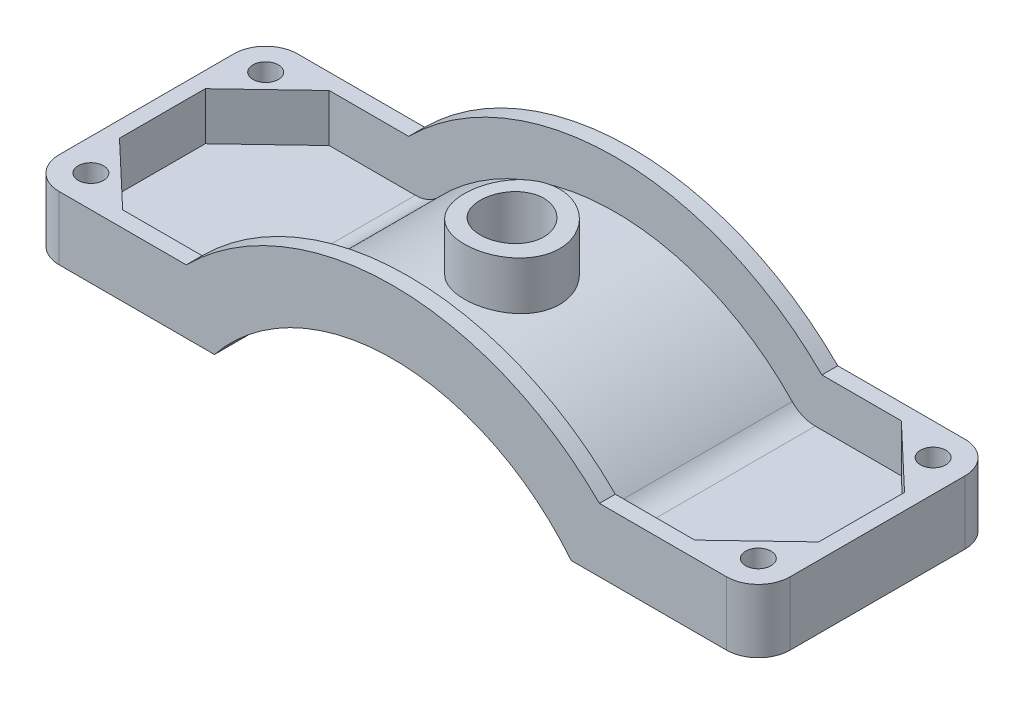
ISO-10303-21;
HEADER;
FILE_DESCRIPTION(('STEP AP214'),'2;1');
FILE_NAME('part.step','',(''),(''),'','','');
FILE_SCHEMA(('AUTOMOTIVE_DESIGN { 1 0 10303 214 1 1 1 1 }'));
ENDSEC;
DATA;
#1=APPLICATION_CONTEXT('core data for automotive mechanical design processes');
#2=APPLICATION_PROTOCOL_DEFINITION('international standard','automotive_design',2000,#1);
#3=PRODUCT_CONTEXT('',#1,'mechanical');
#4=PRODUCT('Part','Part','',(#3));
#5=PRODUCT_RELATED_PRODUCT_CATEGORY('part','',(#4));
#6=PRODUCT_DEFINITION_FORMATION('','',#4);
#7=PRODUCT_DEFINITION_CONTEXT('part definition',#1,'design');
#8=PRODUCT_DEFINITION('design','',#6,#7);
#9=PRODUCT_DEFINITION_SHAPE('','',#8);
#10=(LENGTH_UNIT() NAMED_UNIT(*) SI_UNIT(.MILLI.,.METRE.));
#11=(NAMED_UNIT(*) PLANE_ANGLE_UNIT() SI_UNIT($,.RADIAN.));
#12=(NAMED_UNIT(*) SI_UNIT($,.STERADIAN.) SOLID_ANGLE_UNIT());
#13=UNCERTAINTY_MEASURE_WITH_UNIT(LENGTH_MEASURE(1.E-05),#10,'distance_accuracy_value','');
#14=(GEOMETRIC_REPRESENTATION_CONTEXT(3) GLOBAL_UNCERTAINTY_ASSIGNED_CONTEXT((#13)) GLOBAL_UNIT_ASSIGNED_CONTEXT((#10,
#11,#12)) REPRESENTATION_CONTEXT('',''));
#15=CARTESIAN_POINT('',(0.,0.,0.));
#16=DIRECTION('',(0.,0.,1.));
#17=DIRECTION('',(1.,0.,0.));
#18=AXIS2_PLACEMENT_3D('',#15,#16,#17);
#19=CARTESIAN_POINT('',(180.,0.,37.5));
#20=DIRECTION('',(0.,1.,0.));
#21=DIRECTION('',(0.,0.,1.));
#22=AXIS2_PLACEMENT_3D('',#19,#20,#21);
#23=PLANE('',#22);
#24=CARTESIAN_POINT('',(220.,0.,27.5));
#25=DIRECTION('',(0.,1.,0.));
#26=DIRECTION('',(0.,0.,-1.));
#27=AXIS2_PLACEMENT_3D('',#24,#25,#26);
#28=CIRCLE('',#27,4.);
#29=CARTESIAN_POINT('',(220.,0.,23.5));
#30=VERTEX_POINT('',#29);
#31=EDGE_CURVE('E338',#30,#30,#28,.T.);
#32=ORIENTED_EDGE('',*,*,#31,.F.);
#33=EDGE_LOOP('',(#32));
#34=FACE_BOUND('',#33,.T.);
#35=DIRECTION('',(-0.724999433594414,0.,-0.688749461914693));
#36=VECTOR('',#35,1.);
#37=CARTESIAN_POINT('',(205.,0.,-32.5));
#38=LINE('',#37,#36);
#39=CARTESIAN_POINT('',(225.,0.,-13.5));
#40=VERTEX_POINT('',#39);
#41=CARTESIAN_POINT('',(205.,0.,-32.5));
#42=VERTEX_POINT('',#41);
#43=EDGE_CURVE('E211',#40,#42,#38,.T.);
#44=ORIENTED_EDGE('',*,*,#43,.F.);
#45=DIRECTION('',(0.,0.,-1.));
#46=VECTOR('',#45,1.);
#47=CARTESIAN_POINT('',(225.,0.,37.5));
#48=LINE('',#47,#46);
#49=CARTESIAN_POINT('',(225.,0.,13.5));
#50=VERTEX_POINT('',#49);
#51=EDGE_CURVE('E215',#50,#40,#48,.T.);
#52=ORIENTED_EDGE('',*,*,#51,.F.);
#53=DIRECTION('',(-0.724999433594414,0.,0.688749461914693));
#54=VECTOR('',#53,1.);
#55=CARTESIAN_POINT('',(205.,0.,32.5));
#56=LINE('',#55,#54);
#57=CARTESIAN_POINT('',(205.,0.,32.5));
#58=VERTEX_POINT('',#57);
#59=EDGE_CURVE('E329',#50,#58,#56,.T.);
#60=ORIENTED_EDGE('',*,*,#59,.T.);
#61=DIRECTION('',(1.,0.,0.));
#62=VECTOR('',#61,1.);
#63=CARTESIAN_POINT('',(115.,0.,32.5));
#64=LINE('',#63,#62);
#65=CARTESIAN_POINT('',(180.,0.,32.5));
#66=VERTEX_POINT('',#65);
#67=EDGE_CURVE('E254',#66,#58,#64,.T.);
#68=ORIENTED_EDGE('',*,*,#67,.F.);
#69=DIRECTION('',(0.,0.,-1.));
#70=VECTOR('',#69,1.);
#71=CARTESIAN_POINT('',(180.,0.,37.5));
#72=LINE('',#71,#70);
#73=CARTESIAN_POINT('',(180.,0.,37.5));
#74=VERTEX_POINT('',#73);
#75=EDGE_CURVE('E497',#74,#66,#72,.T.);
#76=ORIENTED_EDGE('',*,*,#75,.F.);
#77=DIRECTION('',(1.,0.,0.));
#78=VECTOR('',#77,1.);
#79=CARTESIAN_POINT('',(180.,0.,37.5));
#80=LINE('',#79,#78);
#81=CARTESIAN_POINT('',(220.,0.,37.5));
#82=VERTEX_POINT('',#81);
#83=EDGE_CURVE('E535',#74,#82,#80,.T.);
#84=ORIENTED_EDGE('',*,*,#83,.T.);
#85=CARTESIAN_POINT('',(220.,0.,27.5));
#86=DIRECTION('',(0.,1.,0.));
#87=DIRECTION('',(0.,0.,1.));
#88=AXIS2_PLACEMENT_3D('',#85,#86,#87);
#89=CIRCLE('',#88,10.);
#90=CARTESIAN_POINT('',(230.,0.,27.5));
#91=VERTEX_POINT('',#90);
#92=EDGE_CURVE('E432',#82,#91,#89,.T.);
#93=ORIENTED_EDGE('',*,*,#92,.T.);
#94=DIRECTION('',(0.,0.,-1.));
#95=VECTOR('',#94,1.);
#96=CARTESIAN_POINT('',(230.,0.,37.5));
#97=LINE('',#96,#95);
#98=CARTESIAN_POINT('',(230.,0.,-27.5));
#99=VERTEX_POINT('',#98);
#100=EDGE_CURVE('E496',#91,#99,#97,.T.);
#101=ORIENTED_EDGE('',*,*,#100,.T.);
#102=CARTESIAN_POINT('',(220.,0.,-27.5));
#103=DIRECTION('',(0.,1.,0.));
#104=DIRECTION('',(0.,0.,1.));
#105=AXIS2_PLACEMENT_3D('',#102,#103,#104);
#106=CIRCLE('',#105,10.);
#107=CARTESIAN_POINT('',(220.,0.,-37.5));
#108=VERTEX_POINT('',#107);
#109=EDGE_CURVE('E430',#99,#108,#106,.T.);
#110=ORIENTED_EDGE('',*,*,#109,.T.);
#111=DIRECTION('',(1.,0.,0.));
#112=VECTOR('',#111,1.);
#113=CARTESIAN_POINT('',(180.,0.,-37.5));
#114=LINE('',#113,#112);
#115=CARTESIAN_POINT('',(180.,0.,-37.5));
#116=VERTEX_POINT('',#115);
#117=EDGE_CURVE('E480',#116,#108,#114,.T.);
#118=ORIENTED_EDGE('',*,*,#117,.F.);
#119=CARTESIAN_POINT('',(180.,0.,-32.5));
#120=VERTEX_POINT('',#119);
#121=EDGE_CURVE('E499',#120,#116,#72,.T.);
#122=ORIENTED_EDGE('',*,*,#121,.F.);
#123=DIRECTION('',(1.,0.,0.));
#124=VECTOR('',#123,1.);
#125=CARTESIAN_POINT('',(115.,0.,-32.5));
#126=LINE('',#125,#124);
#127=EDGE_CURVE('E218',#120,#42,#126,.T.);
#128=ORIENTED_EDGE('',*,*,#127,.T.);
#129=EDGE_LOOP('',(#44,#52,#60,#68,#76,#84,#93,#101,#110,#118,#122,#128));
#130=FACE_BOUND('',#129,.T.);
#131=CARTESIAN_POINT('',(220.,0.,-27.5));
#132=DIRECTION('',(0.,-1.,0.));
#133=DIRECTION('',(0.,0.,1.));
#134=AXIS2_PLACEMENT_3D('',#131,#132,#133);
#135=CIRCLE('',#134,4.);
#136=CARTESIAN_POINT('',(220.,0.,-23.5));
#137=VERTEX_POINT('',#136);
#138=EDGE_CURVE('E346',#137,#137,#135,.T.);
#139=ORIENTED_EDGE('',*,*,#138,.T.);
#140=EDGE_LOOP('',(#139));
#141=FACE_BOUND('',#140,.T.);
#142=ADVANCED_FACE('F36',(#34,#130,#141),#23,.T.);
#143=CARTESIAN_POINT('',(180.,-20.,37.5));
#144=DIRECTION('',(0.,1.,0.));
#145=DIRECTION('',(0.,0.,1.));
#146=AXIS2_PLACEMENT_3D('',#143,#144,#145);
#147=PLANE('',#146);
#148=DIRECTION('',(1.,0.,0.));
#149=VECTOR('',#148,1.);
#150=CARTESIAN_POINT('',(180.,-20.,-37.5));
#151=LINE('',#150,#149);
#152=CARTESIAN_POINT('',(171.118661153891,-20.,-37.5));
#153=VERTEX_POINT('',#152);
#154=CARTESIAN_POINT('',(220.,-20.,-37.5));
#155=VERTEX_POINT('',#154);
#156=EDGE_CURVE('E485',#153,#155,#151,.T.);
#157=ORIENTED_EDGE('',*,*,#156,.T.);
#158=CARTESIAN_POINT('',(220.,-20.,-27.5));
#159=DIRECTION('',(0.,1.,0.));
#160=DIRECTION('',(0.,0.,1.));
#161=AXIS2_PLACEMENT_3D('',#158,#159,#160);
#162=CIRCLE('',#161,10.);
#163=CARTESIAN_POINT('',(230.,-20.,-27.5));
#164=VERTEX_POINT('',#163);
#165=EDGE_CURVE('E439',#155,#164,#162,.F.);
#166=ORIENTED_EDGE('',*,*,#165,.T.);
#167=DIRECTION('',(0.,0.,-1.));
#168=VECTOR('',#167,1.);
#169=CARTESIAN_POINT('',(230.,-20.,37.5));
#170=LINE('',#169,#168);
#171=CARTESIAN_POINT('',(230.,-20.,27.5));
#172=VERTEX_POINT('',#171);
#173=EDGE_CURVE('E449',#172,#164,#170,.T.);
#174=ORIENTED_EDGE('',*,*,#173,.F.);
#175=CARTESIAN_POINT('',(220.,-20.,27.5));
#176=DIRECTION('',(0.,1.,0.));
#177=DIRECTION('',(0.,0.,1.));
#178=AXIS2_PLACEMENT_3D('',#175,#176,#177);
#179=CIRCLE('',#178,10.);
#180=CARTESIAN_POINT('',(220.,-20.,37.5));
#181=VERTEX_POINT('',#180);
#182=EDGE_CURVE('E441',#172,#181,#179,.F.);
#183=ORIENTED_EDGE('',*,*,#182,.T.);
#184=DIRECTION('',(1.,0.,0.));
#185=VECTOR('',#184,1.);
#186=CARTESIAN_POINT('',(180.,-20.,37.5));
#187=LINE('',#186,#185);
#188=CARTESIAN_POINT('',(171.118661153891,-20.,37.5));
#189=VERTEX_POINT('',#188);
#190=EDGE_CURVE('E520',#189,#181,#187,.T.);
#191=ORIENTED_EDGE('',*,*,#190,.F.);
#192=DIRECTION('',(0.,0.,-1.));
#193=VECTOR('',#192,1.);
#194=CARTESIAN_POINT('',(171.118661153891,-20.,37.5));
#195=LINE('',#194,#193);
#196=EDGE_CURVE('E515',#189,#153,#195,.T.);
#197=ORIENTED_EDGE('',*,*,#196,.T.);
#198=EDGE_LOOP('',(#157,#166,#174,#183,#191,#197));
#199=FACE_BOUND('',#198,.T.);
#200=CARTESIAN_POINT('',(220.,-20.,27.5));
#201=DIRECTION('',(0.,1.,0.));
#202=DIRECTION('',(0.,0.,-1.));
#203=AXIS2_PLACEMENT_3D('',#200,#201,#202);
#204=CIRCLE('',#203,4.);
#205=CARTESIAN_POINT('',(220.,-20.,23.5));
#206=VERTEX_POINT('',#205);
#207=EDGE_CURVE('E334',#206,#206,#204,.T.);
#208=ORIENTED_EDGE('',*,*,#207,.T.);
#209=EDGE_LOOP('',(#208));
#210=FACE_BOUND('',#209,.T.);
#211=CARTESIAN_POINT('',(220.,-20.,-27.5));
#212=DIRECTION('',(0.,-1.,0.));
#213=DIRECTION('',(0.,0.,1.));
#214=AXIS2_PLACEMENT_3D('',#211,#212,#213);
#215=CIRCLE('',#214,4.);
#216=CARTESIAN_POINT('',(220.,-20.,-23.5));
#217=VERTEX_POINT('',#216);
#218=EDGE_CURVE('E345',#217,#217,#215,.T.);
#219=ORIENTED_EDGE('',*,*,#218,.F.);
#220=EDGE_LOOP('',(#219));
#221=FACE_BOUND('',#220,.T.);
#222=ADVANCED_FACE('F355',(#199,#210,#221),#147,.F.);
#223=CARTESIAN_POINT('',(180.,-15.,37.5));
#224=DIRECTION('',(0.,1.,0.));
#225=DIRECTION('',(0.,0.,1.));
#226=AXIS2_PLACEMENT_3D('',#223,#224,#225);
#227=PLANE('',#226);
#228=DIRECTION('',(-0.724999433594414,0.,-0.688749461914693));
#229=VECTOR('',#228,1.);
#230=CARTESIAN_POINT('',(205.,-15.,-32.5));
#231=LINE('',#230,#229);
#232=CARTESIAN_POINT('',(225.,-15.,-13.5));
#233=VERTEX_POINT('',#232);
#234=CARTESIAN_POINT('',(205.,-15.,-32.5));
#235=VERTEX_POINT('',#234);
#236=EDGE_CURVE('E227',#233,#235,#231,.T.);
#237=ORIENTED_EDGE('',*,*,#236,.T.);
#238=DIRECTION('',(1.,0.,0.));
#239=VECTOR('',#238,1.);
#240=CARTESIAN_POINT('',(115.,-15.,-32.5));
#241=LINE('',#240,#239);
#242=CARTESIAN_POINT('',(177.897345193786,-15.,-32.5));
#243=VERTEX_POINT('',#242);
#244=EDGE_CURVE('E243',#243,#235,#241,.T.);
#245=ORIENTED_EDGE('',*,*,#244,.F.);
#246=DIRECTION('',(0.,0.,1.));
#247=VECTOR('',#246,1.);
#248=CARTESIAN_POINT('',(177.897345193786,-15.,32.5));
#249=LINE('',#248,#247);
#250=CARTESIAN_POINT('',(177.897345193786,-15.,32.5));
#251=VERTEX_POINT('',#250);
#252=EDGE_CURVE('E395',#243,#251,#249,.T.);
#253=ORIENTED_EDGE('',*,*,#252,.T.);
#254=DIRECTION('',(1.,0.,0.));
#255=VECTOR('',#254,1.);
#256=CARTESIAN_POINT('',(115.,-15.,32.5));
#257=LINE('',#256,#255);
#258=CARTESIAN_POINT('',(205.,-15.,32.5));
#259=VERTEX_POINT('',#258);
#260=EDGE_CURVE('E256',#251,#259,#257,.T.);
#261=ORIENTED_EDGE('',*,*,#260,.T.);
#262=DIRECTION('',(-0.724999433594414,0.,0.688749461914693));
#263=VECTOR('',#262,1.);
#264=CARTESIAN_POINT('',(205.,-15.,32.5));
#265=LINE('',#264,#263);
#266=CARTESIAN_POINT('',(225.,-15.,13.5));
#267=VERTEX_POINT('',#266);
#268=EDGE_CURVE('E59',#267,#259,#265,.T.);
#269=ORIENTED_EDGE('',*,*,#268,.F.);
#270=DIRECTION('',(0.,0.,-1.));
#271=VECTOR('',#270,1.);
#272=CARTESIAN_POINT('',(225.,-15.,37.5));
#273=LINE('',#272,#271);
#274=EDGE_CURVE('E230',#267,#233,#273,.T.);
#275=ORIENTED_EDGE('',*,*,#274,.T.);
#276=EDGE_LOOP('',(#237,#245,#253,#261,#269,#275));
#277=FACE_BOUND('',#276,.T.);
#278=ADVANCED_FACE('F282',(#277),#227,.T.);
#279=CARTESIAN_POINT('',(225.,0.,37.5));
#280=DIRECTION('',(1.,0.,0.));
#281=DIRECTION('',(0.,0.,-1.));
#282=AXIS2_PLACEMENT_3D('',#279,#280,#281);
#283=PLANE('',#282);
#284=ORIENTED_EDGE('',*,*,#51,.T.);
#285=DIRECTION('',(0.,-1.,0.));
#286=VECTOR('',#285,1.);
#287=CARTESIAN_POINT('',(225.,27.5862284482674,-13.5));
#288=LINE('',#287,#286);
#289=EDGE_CURVE('E222',#40,#233,#288,.T.);
#290=ORIENTED_EDGE('',*,*,#289,.T.);
#291=ORIENTED_EDGE('',*,*,#274,.F.);
#292=DIRECTION('',(0.,-1.,0.));
#293=VECTOR('',#292,1.);
#294=CARTESIAN_POINT('',(225.,27.5862284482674,13.5));
#295=LINE('',#294,#293);
#296=EDGE_CURVE('E51',#50,#267,#295,.T.);
#297=ORIENTED_EDGE('',*,*,#296,.F.);
#298=EDGE_LOOP('',(#284,#290,#291,#297));
#299=FACE_BOUND('',#298,.T.);
#300=ADVANCED_FACE('F229',(#299),#283,.F.);
#301=CARTESIAN_POINT('',(115.,-65.1076032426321,32.5));
#302=DIRECTION('',(0.,0.,-1.));
#303=DIRECTION('',(-1.,0.,0.));
#304=AXIS2_PLACEMENT_3D('',#301,#302,#303);
#305=PLANE('',#304);
#306=ORIENTED_EDGE('',*,*,#67,.T.);
#307=DIRECTION('',(0.,-1.,0.));
#308=VECTOR('',#307,1.);
#309=CARTESIAN_POINT('',(205.,27.5862284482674,32.5));
#310=LINE('',#309,#308);
#311=EDGE_CURVE('E332',#58,#259,#310,.T.);
#312=ORIENTED_EDGE('',*,*,#311,.T.);
#313=ORIENTED_EDGE('',*,*,#260,.F.);
#314=CARTESIAN_POINT('',(177.897345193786,-5.,32.5));
#315=DIRECTION('',(0.,0.,-1.));
#316=DIRECTION('',(-1.,0.,0.));
#317=AXIS2_PLACEMENT_3D('',#314,#315,#316);
#318=CIRCLE('',#317,10.);
#319=CARTESIAN_POINT('',(170.667765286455,-11.9089199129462,32.5));
#320=VERTEX_POINT('',#319);
#321=EDGE_CURVE('E44',#251,#320,#318,.T.);
#322=ORIENTED_EDGE('',*,*,#321,.T.);
#323=CARTESIAN_POINT('',(115.,-65.1076032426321,32.5));
#324=DIRECTION('',(0.,0.,-1.));
#325=DIRECTION('',(-1.,0.,0.));
#326=AXIS2_PLACEMENT_3D('',#323,#324,#325);
#327=CIRCLE('',#326,77.);
#328=CARTESIAN_POINT('',(59.3322347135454,-11.9089199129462,32.5));
#329=VERTEX_POINT('',#328);
#330=EDGE_CURVE('E292',#329,#320,#327,.T.);
#331=ORIENTED_EDGE('',*,*,#330,.F.);
#332=CARTESIAN_POINT('',(52.1026548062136,-5.,32.5));
#333=DIRECTION('',(0.,0.,-1.));
#334=DIRECTION('',(-1.,0.,0.));
#335=AXIS2_PLACEMENT_3D('',#332,#333,#334);
#336=CIRCLE('',#335,10.);
#337=CARTESIAN_POINT('',(52.1026548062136,-15.,32.5));
#338=VERTEX_POINT('',#337);
#339=EDGE_CURVE('E401',#329,#338,#336,.T.);
#340=ORIENTED_EDGE('',*,*,#339,.T.);
#341=DIRECTION('',(1.,0.,0.));
#342=VECTOR('',#341,1.);
#343=CARTESIAN_POINT('',(115.,-15.,32.5));
#344=LINE('',#343,#342);
#345=CARTESIAN_POINT('',(25.,-15.,32.5));
#346=VERTEX_POINT('',#345);
#347=EDGE_CURVE('E251',#346,#338,#344,.T.);
#348=ORIENTED_EDGE('',*,*,#347,.F.);
#349=DIRECTION('',(0.,-1.,0.));
#350=VECTOR('',#349,1.);
#351=CARTESIAN_POINT('',(25.,27.5862284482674,32.5));
#352=LINE('',#351,#350);
#353=CARTESIAN_POINT('',(25.,0.,32.5));
#354=VERTEX_POINT('',#353);
#355=EDGE_CURVE('E312',#354,#346,#352,.T.);
#356=ORIENTED_EDGE('',*,*,#355,.F.);
#357=DIRECTION('',(1.,0.,0.));
#358=VECTOR('',#357,1.);
#359=CARTESIAN_POINT('',(115.,0.,32.5));
#360=LINE('',#359,#358);
#361=CARTESIAN_POINT('',(50.,0.,32.5));
#362=VERTEX_POINT('',#361);
#363=EDGE_CURVE('E249',#354,#362,#360,.T.);
#364=ORIENTED_EDGE('',*,*,#363,.T.);
#365=CARTESIAN_POINT('',(115.,-65.1076032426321,32.5));
#366=DIRECTION('',(0.,0.,-1.));
#367=DIRECTION('',(-1.,0.,0.));
#368=AXIS2_PLACEMENT_3D('',#365,#366,#367);
#369=CIRCLE('',#368,92.);
#370=EDGE_CURVE('E252',#362,#66,#369,.T.);
#371=ORIENTED_EDGE('',*,*,#370,.T.);
#372=EDGE_LOOP('',(#306,#312,#313,#322,#331,#340,#348,#356,#364,#371));
#373=FACE_BOUND('',#372,.T.);
#374=ADVANCED_FACE('F590',(#373),#305,.T.);
#375=CARTESIAN_POINT('',(0.,0.,37.5));
#376=DIRECTION('',(0.,1.,0.));
#377=DIRECTION('',(0.,0.,1.));
#378=AXIS2_PLACEMENT_3D('',#375,#376,#377);
#379=PLANE('',#378);
#380=CARTESIAN_POINT('',(9.99999999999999,0.,-27.5));
#381=DIRECTION('',(0.,1.,0.));
#382=DIRECTION('',(0.,0.,1.));
#383=AXIS2_PLACEMENT_3D('',#380,#381,#382);
#384=CIRCLE('',#383,4.);
#385=CARTESIAN_POINT('',(9.99999999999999,0.,-23.5));
#386=VERTEX_POINT('',#385);
#387=EDGE_CURVE('E309',#386,#386,#384,.T.);
#388=ORIENTED_EDGE('',*,*,#387,.F.);
#389=EDGE_LOOP('',(#388));
#390=FACE_BOUND('',#389,.T.);
#391=DIRECTION('',(0.724999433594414,0.,0.688749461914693));
#392=VECTOR('',#391,1.);
#393=CARTESIAN_POINT('',(25.,0.,32.5));
#394=LINE('',#393,#392);
#395=CARTESIAN_POINT('',(5.,0.,13.5));
#396=VERTEX_POINT('',#395);
#397=EDGE_CURVE('E317',#396,#354,#394,.T.);
#398=ORIENTED_EDGE('',*,*,#397,.F.);
#399=DIRECTION('',(0.,0.,-1.));
#400=VECTOR('',#399,1.);
#401=CARTESIAN_POINT('',(5.,0.,37.5));
#402=LINE('',#401,#400);
#403=CARTESIAN_POINT('',(5.,0.,-13.5));
#404=VERTEX_POINT('',#403);
#405=EDGE_CURVE('E231',#396,#404,#402,.T.);
#406=ORIENTED_EDGE('',*,*,#405,.T.);
#407=DIRECTION('',(0.724999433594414,0.,-0.688749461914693));
#408=VECTOR('',#407,1.);
#409=CARTESIAN_POINT('',(25.,0.,-32.5));
#410=LINE('',#409,#408);
#411=CARTESIAN_POINT('',(25.,0.,-32.5));
#412=VERTEX_POINT('',#411);
#413=EDGE_CURVE('E289',#404,#412,#410,.T.);
#414=ORIENTED_EDGE('',*,*,#413,.T.);
#415=DIRECTION('',(1.,0.,0.));
#416=VECTOR('',#415,1.);
#417=CARTESIAN_POINT('',(115.,0.,-32.5));
#418=LINE('',#417,#416);
#419=CARTESIAN_POINT('',(50.,0.,-32.5));
#420=VERTEX_POINT('',#419);
#421=EDGE_CURVE('E246',#412,#420,#418,.T.);
#422=ORIENTED_EDGE('',*,*,#421,.T.);
#423=DIRECTION('',(0.,0.,-1.));
#424=VECTOR('',#423,1.);
#425=CARTESIAN_POINT('',(50.,0.,37.5));
#426=LINE('',#425,#424);
#427=CARTESIAN_POINT('',(50.,0.,-37.5));
#428=VERTEX_POINT('',#427);
#429=EDGE_CURVE('E505',#420,#428,#426,.T.);
#430=ORIENTED_EDGE('',*,*,#429,.T.);
#431=DIRECTION('',(1.,0.,0.));
#432=VECTOR('',#431,1.);
#433=CARTESIAN_POINT('',(0.,0.,-37.5));
#434=LINE('',#433,#432);
#435=CARTESIAN_POINT('',(9.99999999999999,0.,-37.5));
#436=VERTEX_POINT('',#435);
#437=EDGE_CURVE('E523',#436,#428,#434,.T.);
#438=ORIENTED_EDGE('',*,*,#437,.F.);
#439=CARTESIAN_POINT('',(9.99999999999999,0.,-27.5));
#440=DIRECTION('',(0.,1.,0.));
#441=DIRECTION('',(0.,0.,1.));
#442=AXIS2_PLACEMENT_3D('',#439,#440,#441);
#443=CIRCLE('',#442,10.);
#444=CARTESIAN_POINT('',(0.,0.,-27.5));
#445=VERTEX_POINT('',#444);
#446=EDGE_CURVE('E426',#436,#445,#443,.T.);
#447=ORIENTED_EDGE('',*,*,#446,.T.);
#448=DIRECTION('',(0.,0.,-1.));
#449=VECTOR('',#448,1.);
#450=CARTESIAN_POINT('',(0.,0.,37.5));
#451=LINE('',#450,#449);
#452=CARTESIAN_POINT('',(0.,0.,27.5));
#453=VERTEX_POINT('',#452);
#454=EDGE_CURVE('E506',#453,#445,#451,.T.);
#455=ORIENTED_EDGE('',*,*,#454,.F.);
#456=CARTESIAN_POINT('',(10.,0.,27.5));
#457=DIRECTION('',(0.,1.,0.));
#458=DIRECTION('',(0.,0.,1.));
#459=AXIS2_PLACEMENT_3D('',#456,#457,#458);
#460=CIRCLE('',#459,10.);
#461=CARTESIAN_POINT('',(10.,0.,37.5));
#462=VERTEX_POINT('',#461);
#463=EDGE_CURVE('E428',#453,#462,#460,.T.);
#464=ORIENTED_EDGE('',*,*,#463,.T.);
#465=DIRECTION('',(1.,0.,0.));
#466=VECTOR('',#465,1.);
#467=CARTESIAN_POINT('',(0.,0.,37.5));
#468=LINE('',#467,#466);
#469=CARTESIAN_POINT('',(50.,0.,37.5));
#470=VERTEX_POINT('',#469);
#471=EDGE_CURVE('E530',#462,#470,#468,.T.);
#472=ORIENTED_EDGE('',*,*,#471,.T.);
#473=EDGE_CURVE('E502',#470,#362,#426,.T.);
#474=ORIENTED_EDGE('',*,*,#473,.T.);
#475=ORIENTED_EDGE('',*,*,#363,.F.);
#476=EDGE_LOOP('',(#398,#406,#414,#422,#430,#438,#447,#455,#464,#472,#474,#475));
#477=FACE_BOUND('',#476,.T.);
#478=CARTESIAN_POINT('',(9.99999999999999,0.,27.5));
#479=DIRECTION('',(0.,-1.,0.));
#480=DIRECTION('',(0.,0.,-1.));
#481=AXIS2_PLACEMENT_3D('',#478,#479,#480);
#482=CIRCLE('',#481,4.);
#483=CARTESIAN_POINT('',(9.99999999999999,0.,23.5));
#484=VERTEX_POINT('',#483);
#485=EDGE_CURVE('E326',#484,#484,#482,.T.);
#486=ORIENTED_EDGE('',*,*,#485,.T.);
#487=EDGE_LOOP('',(#486));
#488=FACE_BOUND('',#487,.T.);
#489=ADVANCED_FACE('F554',(#390,#477,#488),#379,.T.);
#490=CARTESIAN_POINT('',(0.,-20.,37.5));
#491=DIRECTION('',(0.,1.,0.));
#492=DIRECTION('',(0.,0.,1.));
#493=AXIS2_PLACEMENT_3D('',#490,#491,#492);
#494=PLANE('',#493);
#495=DIRECTION('',(0.,0.,-1.));
#496=VECTOR('',#495,1.);
#497=CARTESIAN_POINT('',(0.,-20.,37.5));
#498=LINE('',#497,#496);
#499=CARTESIAN_POINT('',(0.,-20.,27.5));
#500=VERTEX_POINT('',#499);
#501=CARTESIAN_POINT('',(0.,-20.,-27.5));
#502=VERTEX_POINT('',#501);
#503=EDGE_CURVE('E509',#500,#502,#498,.T.);
#504=ORIENTED_EDGE('',*,*,#503,.T.);
#505=CARTESIAN_POINT('',(9.99999999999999,-20.,-27.5));
#506=DIRECTION('',(0.,1.,0.));
#507=DIRECTION('',(0.,0.,1.));
#508=AXIS2_PLACEMENT_3D('',#505,#506,#507);
#509=CIRCLE('',#508,10.);
#510=CARTESIAN_POINT('',(9.99999999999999,-20.,-37.5));
#511=VERTEX_POINT('',#510);
#512=EDGE_CURVE('E417',#502,#511,#509,.F.);
#513=ORIENTED_EDGE('',*,*,#512,.T.);
#514=DIRECTION('',(1.,0.,0.));
#515=VECTOR('',#514,1.);
#516=CARTESIAN_POINT('',(0.,-20.,-37.5));
#517=LINE('',#516,#515);
#518=CARTESIAN_POINT('',(58.8813388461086,-20.,-37.5));
#519=VERTEX_POINT('',#518);
#520=EDGE_CURVE('E521',#511,#519,#517,.T.);
#521=ORIENTED_EDGE('',*,*,#520,.T.);
#522=DIRECTION('',(0.,0.,-1.));
#523=VECTOR('',#522,1.);
#524=CARTESIAN_POINT('',(58.8813388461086,-20.,37.5));
#525=LINE('',#524,#523);
#526=CARTESIAN_POINT('',(58.8813388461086,-20.,37.5));
#527=VERTEX_POINT('',#526);
#528=EDGE_CURVE('E512',#527,#519,#525,.T.);
#529=ORIENTED_EDGE('',*,*,#528,.F.);
#530=DIRECTION('',(1.,0.,0.));
#531=VECTOR('',#530,1.);
#532=CARTESIAN_POINT('',(0.,-20.,37.5));
#533=LINE('',#532,#531);
#534=CARTESIAN_POINT('',(10.,-20.,37.5));
#535=VERTEX_POINT('',#534);
#536=EDGE_CURVE('E528',#535,#527,#533,.T.);
#537=ORIENTED_EDGE('',*,*,#536,.F.);
#538=CARTESIAN_POINT('',(10.,-20.,27.5));
#539=DIRECTION('',(0.,1.,0.));
#540=DIRECTION('',(0.,0.,1.));
#541=AXIS2_PLACEMENT_3D('',#538,#539,#540);
#542=CIRCLE('',#541,10.);
#543=EDGE_CURVE('E419',#535,#500,#542,.F.);
#544=ORIENTED_EDGE('',*,*,#543,.T.);
#545=EDGE_LOOP('',(#504,#513,#521,#529,#537,#544));
#546=FACE_BOUND('',#545,.T.);
#547=CARTESIAN_POINT('',(9.99999999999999,-20.,-27.5));
#548=DIRECTION('',(0.,1.,0.));
#549=DIRECTION('',(0.,0.,1.));
#550=AXIS2_PLACEMENT_3D('',#547,#548,#549);
#551=CIRCLE('',#550,4.);
#552=CARTESIAN_POINT('',(9.99999999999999,-20.,-23.5));
#553=VERTEX_POINT('',#552);
#554=EDGE_CURVE('E303',#553,#553,#551,.T.);
#555=ORIENTED_EDGE('',*,*,#554,.T.);
#556=EDGE_LOOP('',(#555));
#557=FACE_BOUND('',#556,.T.);
#558=CARTESIAN_POINT('',(9.99999999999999,-20.,27.5));
#559=DIRECTION('',(0.,-1.,0.));
#560=DIRECTION('',(0.,0.,-1.));
#561=AXIS2_PLACEMENT_3D('',#558,#559,#560);
#562=CIRCLE('',#561,4.);
#563=CARTESIAN_POINT('',(9.99999999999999,-20.,23.5));
#564=VERTEX_POINT('',#563);
#565=EDGE_CURVE('E325',#564,#564,#562,.T.);
#566=ORIENTED_EDGE('',*,*,#565,.F.);
#567=EDGE_LOOP('',(#566));
#568=FACE_BOUND('',#567,.T.);
#569=ADVANCED_FACE('F563',(#546,#557,#568),#494,.F.);
#570=CARTESIAN_POINT('',(5.,-20.,37.5));
#571=DIRECTION('',(-1.,0.,0.));
#572=DIRECTION('',(0.,0.,1.));
#573=AXIS2_PLACEMENT_3D('',#570,#571,#572);
#574=PLANE('',#573);
#575=ORIENTED_EDGE('',*,*,#405,.F.);
#576=DIRECTION('',(0.,-1.,0.));
#577=VECTOR('',#576,1.);
#578=CARTESIAN_POINT('',(5.,27.5862284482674,13.5));
#579=LINE('',#578,#577);
#580=CARTESIAN_POINT('',(5.,-15.,13.5));
#581=VERTEX_POINT('',#580);
#582=EDGE_CURVE('E315',#396,#581,#579,.T.);
#583=ORIENTED_EDGE('',*,*,#582,.T.);
#584=DIRECTION('',(0.,0.,-1.));
#585=VECTOR('',#584,1.);
#586=CARTESIAN_POINT('',(5.,-15.,37.5));
#587=LINE('',#586,#585);
#588=CARTESIAN_POINT('',(5.,-15.,-13.5));
#589=VERTEX_POINT('',#588);
#590=EDGE_CURVE('E235',#581,#589,#587,.T.);
#591=ORIENTED_EDGE('',*,*,#590,.T.);
#592=DIRECTION('',(0.,-1.,0.));
#593=VECTOR('',#592,1.);
#594=CARTESIAN_POINT('',(5.,27.5862284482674,-13.5));
#595=LINE('',#594,#593);
#596=EDGE_CURVE('E302',#404,#589,#595,.T.);
#597=ORIENTED_EDGE('',*,*,#596,.F.);
#598=EDGE_LOOP('',(#575,#583,#591,#597));
#599=FACE_BOUND('',#598,.T.);
#600=ADVANCED_FACE('F597',(#599),#574,.F.);
#601=CARTESIAN_POINT('',(0.,-15.,37.5));
#602=DIRECTION('',(0.,1.,0.));
#603=DIRECTION('',(0.,0.,1.));
#604=AXIS2_PLACEMENT_3D('',#601,#602,#603);
#605=PLANE('',#604);
#606=DIRECTION('',(0.724999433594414,0.,0.688749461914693));
#607=VECTOR('',#606,1.);
#608=CARTESIAN_POINT('',(25.,-15.,32.5));
#609=LINE('',#608,#607);
#610=EDGE_CURVE('E318',#581,#346,#609,.T.);
#611=ORIENTED_EDGE('',*,*,#610,.T.);
#612=ORIENTED_EDGE('',*,*,#347,.T.);
#613=DIRECTION('',(0.,0.,1.));
#614=VECTOR('',#613,1.);
#615=CARTESIAN_POINT('',(52.1026548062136,-15.,-32.5));
#616=LINE('',#615,#614);
#617=CARTESIAN_POINT('',(52.1026548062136,-15.,-32.5));
#618=VERTEX_POINT('',#617);
#619=EDGE_CURVE('E11',#338,#618,#616,.F.);
#620=ORIENTED_EDGE('',*,*,#619,.T.);
#621=DIRECTION('',(1.,0.,0.));
#622=VECTOR('',#621,1.);
#623=CARTESIAN_POINT('',(115.,-15.,-32.5));
#624=LINE('',#623,#622);
#625=CARTESIAN_POINT('',(25.,-15.,-32.5));
#626=VERTEX_POINT('',#625);
#627=EDGE_CURVE('E247',#626,#618,#624,.T.);
#628=ORIENTED_EDGE('',*,*,#627,.F.);
#629=DIRECTION('',(0.724999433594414,0.,-0.688749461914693));
#630=VECTOR('',#629,1.);
#631=CARTESIAN_POINT('',(25.,-15.,-32.5));
#632=LINE('',#631,#630);
#633=EDGE_CURVE('E306',#589,#626,#632,.T.);
#634=ORIENTED_EDGE('',*,*,#633,.F.);
#635=ORIENTED_EDGE('',*,*,#590,.F.);
#636=EDGE_LOOP('',(#611,#612,#620,#628,#634,#635));
#637=FACE_BOUND('',#636,.T.);
#638=ADVANCED_FACE('F660',(#637),#605,.T.);
#639=CARTESIAN_POINT('',(115.,-65.1076032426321,-32.5));
#640=DIRECTION('',(0.,0.,-1.));
#641=DIRECTION('',(-1.,0.,0.));
#642=AXIS2_PLACEMENT_3D('',#639,#640,#641);
#643=PLANE('',#642);
#644=ORIENTED_EDGE('',*,*,#244,.T.);
#645=DIRECTION('',(0.,-1.,0.));
#646=VECTOR('',#645,1.);
#647=CARTESIAN_POINT('',(205.,27.5862284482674,-32.5));
#648=LINE('',#647,#646);
#649=EDGE_CURVE('E221',#42,#235,#648,.T.);
#650=ORIENTED_EDGE('',*,*,#649,.F.);
#651=ORIENTED_EDGE('',*,*,#127,.F.);
#652=CARTESIAN_POINT('',(115.,-65.1076032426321,-32.5));
#653=DIRECTION('',(0.,0.,-1.));
#654=DIRECTION('',(-1.,0.,0.));
#655=AXIS2_PLACEMENT_3D('',#652,#653,#654);
#656=CIRCLE('',#655,92.);
#657=EDGE_CURVE('E242',#420,#120,#656,.T.);
#658=ORIENTED_EDGE('',*,*,#657,.F.);
#659=ORIENTED_EDGE('',*,*,#421,.F.);
#660=DIRECTION('',(0.,-1.,0.));
#661=VECTOR('',#660,1.);
#662=CARTESIAN_POINT('',(25.,27.5862284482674,-32.5));
#663=LINE('',#662,#661);
#664=EDGE_CURVE('E299',#412,#626,#663,.T.);
#665=ORIENTED_EDGE('',*,*,#664,.T.);
#666=ORIENTED_EDGE('',*,*,#627,.T.);
#667=CARTESIAN_POINT('',(52.1026548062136,-5.,-32.5));
#668=DIRECTION('',(0.,0.,-1.));
#669=DIRECTION('',(-1.,0.,0.));
#670=AXIS2_PLACEMENT_3D('',#667,#668,#669);
#671=CIRCLE('',#670,10.);
#672=CARTESIAN_POINT('',(59.3322347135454,-11.9089199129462,-32.5));
#673=VERTEX_POINT('',#672);
#674=EDGE_CURVE('E408',#618,#673,#671,.F.);
#675=ORIENTED_EDGE('',*,*,#674,.T.);
#676=CARTESIAN_POINT('',(115.,-65.1076032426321,-32.5));
#677=DIRECTION('',(0.,0.,-1.));
#678=DIRECTION('',(-1.,0.,0.));
#679=AXIS2_PLACEMENT_3D('',#676,#677,#678);
#680=CIRCLE('',#679,77.);
#681=CARTESIAN_POINT('',(170.667765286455,-11.9089199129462,-32.5));
#682=VERTEX_POINT('',#681);
#683=EDGE_CURVE('E239',#673,#682,#680,.T.);
#684=ORIENTED_EDGE('',*,*,#683,.T.);
#685=CARTESIAN_POINT('',(177.897345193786,-5.,-32.5));
#686=DIRECTION('',(0.,0.,-1.));
#687=DIRECTION('',(-1.,0.,0.));
#688=AXIS2_PLACEMENT_3D('',#685,#686,#687);
#689=CIRCLE('',#688,10.);
#690=EDGE_CURVE('E406',#682,#243,#689,.F.);
#691=ORIENTED_EDGE('',*,*,#690,.T.);
#692=EDGE_LOOP('',(#644,#650,#651,#658,#659,#665,#666,#675,#684,#691));
#693=FACE_BOUND('',#692,.T.);
#694=ADVANCED_FACE('F467',(#693),#643,.F.);
#695=CARTESIAN_POINT('',(115.,-65.1076032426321,37.5));
#696=DIRECTION('',(0.,0.,-1.));
#697=DIRECTION('',(-1.,0.,0.));
#698=AXIS2_PLACEMENT_3D('',#695,#696,#697);
#699=CYLINDRICAL_SURFACE('',#698,92.);
#700=CARTESIAN_POINT('',(115.,26.8923967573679,-10.));
#701=CARTESIAN_POINT('',(114.719934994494,26.8923976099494,-10.0000028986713));
#702=CARTESIAN_POINT('',(114.439913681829,26.8911153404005,-9.9882301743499));
#703=CARTESIAN_POINT('',(113.881780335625,26.8860239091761,-9.94122764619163));
#704=CARTESIAN_POINT('',(113.603668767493,26.8822141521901,-9.90599231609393));
#705=CARTESIAN_POINT('',(113.051169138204,26.8721689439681,-9.8122705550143));
#706=CARTESIAN_POINT('',(112.776784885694,26.8659311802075,-9.75376195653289));
#707=CARTESIAN_POINT('',(112.233949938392,26.8512065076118,-9.61392332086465));
#708=CARTESIAN_POINT('',(111.965499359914,26.8427195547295,-9.5325928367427));
#709=CARTESIAN_POINT('',(111.43661157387,26.8237420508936,-9.34776361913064));
#710=CARTESIAN_POINT('',(111.176169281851,26.8132528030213,-9.24427929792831));
#711=CARTESIAN_POINT('',(110.664943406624,26.7905619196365,-9.01585645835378));
#712=CARTESIAN_POINT('',(110.414159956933,26.7783602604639,-8.89091764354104));
#713=CARTESIAN_POINT('',(109.924060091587,26.7525896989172,-8.62050743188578));
#714=CARTESIAN_POINT('',(109.684741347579,26.7390210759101,-8.47504022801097));
#715=CARTESIAN_POINT('',(109.219181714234,26.7108945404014,-8.16458346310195));
#716=CARTESIAN_POINT('',(108.992940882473,26.6963366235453,-7.99959381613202));
#717=CARTESIAN_POINT('',(108.554286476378,26.6665831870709,-7.6505964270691));
#718=CARTESIAN_POINT('',(108.341928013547,26.6513854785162,-7.466519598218));
#719=CARTESIAN_POINT('',(107.933456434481,26.62083247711,-7.08115815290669));
#720=CARTESIAN_POINT('',(107.737343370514,26.6054771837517,-6.87987348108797));
#721=CARTESIAN_POINT('',(107.362726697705,26.5750417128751,-6.46149406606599));
#722=CARTESIAN_POINT('',(107.184224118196,26.5599615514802,-6.24439839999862));
#723=CARTESIAN_POINT('',(106.846102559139,26.5305043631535,-5.79593107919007));
#724=CARTESIAN_POINT('',(106.686483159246,26.5161273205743,-5.56455974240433));
#725=CARTESIAN_POINT('',(106.386874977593,26.4884489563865,-5.08855227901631));
#726=CARTESIAN_POINT('',(106.246937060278,26.4751504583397,-4.84388396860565));
#727=CARTESIAN_POINT('',(105.988179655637,26.4500507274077,-4.34354885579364));
#728=CARTESIAN_POINT('',(105.869360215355,26.438249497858,-4.08788202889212));
#729=CARTESIAN_POINT('',(105.653704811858,26.4164838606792,-3.56736937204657));
#730=CARTESIAN_POINT('',(105.556868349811,26.4065194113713,-3.30252375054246));
#731=CARTESIAN_POINT('',(105.385885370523,26.3887146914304,-2.76553724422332));
#732=CARTESIAN_POINT('',(105.311738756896,26.3808744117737,-2.49339639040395));
#733=CARTESIAN_POINT('',(105.186931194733,26.3675715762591,-1.94486087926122));
#734=CARTESIAN_POINT('',(105.136178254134,26.3620997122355,-1.66848737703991));
#735=CARTESIAN_POINT('',(105.058100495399,26.3536463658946,-1.11241279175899));
#736=CARTESIAN_POINT('',(105.03077562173,26.3506648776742,-0.832711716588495));
#737=CARTESIAN_POINT('',(104.999757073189,26.3472784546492,-0.271994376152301));
#738=CARTESIAN_POINT('',(104.996062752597,26.3468734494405,0.00902185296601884));
#739=CARTESIAN_POINT('',(105.012331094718,26.3486515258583,0.570360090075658));
#740=CARTESIAN_POINT('',(105.03229370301,26.3508346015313,0.850682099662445));
#741=CARTESIAN_POINT('',(105.095590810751,26.3577108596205,1.40742054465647));
#742=CARTESIAN_POINT('',(105.138824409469,26.3623932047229,1.68384859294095));
#743=CARTESIAN_POINT('',(105.248280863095,26.3741271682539,2.23206259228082));
#744=CARTESIAN_POINT('',(105.314503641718,26.3811787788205,2.503848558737));
#745=CARTESIAN_POINT('',(105.469456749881,26.397450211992,3.04086259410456));
#746=CARTESIAN_POINT('',(105.558187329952,26.4066700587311,3.30609058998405));
#747=CARTESIAN_POINT('',(105.757514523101,26.4270158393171,3.828122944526));
#748=CARTESIAN_POINT('',(105.868111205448,26.4381417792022,4.0849272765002));
#749=CARTESIAN_POINT('',(106.110633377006,26.4620097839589,4.5888466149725));
#750=CARTESIAN_POINT('',(106.242603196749,26.4747551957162,4.83594012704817));
#751=CARTESIAN_POINT('',(106.526765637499,26.5014828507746,5.3181403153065));
#752=CARTESIAN_POINT('',(106.678958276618,26.5154650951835,5.5532469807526));
#753=CARTESIAN_POINT('',(107.002496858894,26.5442724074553,6.00984488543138));
#754=CARTESIAN_POINT('',(107.173843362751,26.5590974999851,6.23133572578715));
#755=CARTESIAN_POINT('',(107.534485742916,26.5891732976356,6.6591569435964));
#756=CARTESIAN_POINT('',(107.723781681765,26.6044240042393,6.86548726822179));
#757=CARTESIAN_POINT('',(108.120036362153,26.6350029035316,7.26258813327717));
#758=CARTESIAN_POINT('',(108.327082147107,26.6503310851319,7.45327182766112));
#759=CARTESIAN_POINT('',(108.756525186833,26.6805514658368,7.81652844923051));
#760=CARTESIAN_POINT('',(108.97892249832,26.6954436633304,7.98910130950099));
#761=CARTESIAN_POINT('',(109.437508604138,26.7243708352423,8.31491450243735));
#762=CARTESIAN_POINT('',(109.673697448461,26.738405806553,8.46815476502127));
#763=CARTESIAN_POINT('',(110.158205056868,26.7652212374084,8.75420841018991));
#764=CARTESIAN_POINT('',(110.40652380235,26.7780016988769,8.88702182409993));
#765=CARTESIAN_POINT('',(110.913597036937,26.801948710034,9.13129379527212));
#766=CARTESIAN_POINT('',(111.172353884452,26.8131148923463,9.24274749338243));
#767=CARTESIAN_POINT('',(111.698414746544,26.8335127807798,9.4434522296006));
#768=CARTESIAN_POINT('',(111.965718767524,26.8427444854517,9.53270325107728));
#769=CARTESIAN_POINT('',(112.506958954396,26.8590104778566,9.68834532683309));
#770=CARTESIAN_POINT('',(112.78089492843,26.8660448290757,9.75473704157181));
#771=CARTESIAN_POINT('',(113.3334415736,26.8777159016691,9.8641726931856));
#772=CARTESIAN_POINT('',(113.612052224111,26.8823526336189,9.90721673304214));
#773=CARTESIAN_POINT('',(114.17052231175,26.8890790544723,9.96947882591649));
#774=CARTESIAN_POINT('',(114.450368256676,26.8911815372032,9.98881656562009));
#775=CARTESIAN_POINT('',(115.010702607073,26.8928227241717,10.0039210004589));
#776=CARTESIAN_POINT('',(115.29119101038,26.8923614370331,9.99968777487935));
#777=CARTESIAN_POINT('',(115.850801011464,26.8888881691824,9.96768196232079));
#778=CARTESIAN_POINT('',(116.12992263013,26.8858762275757,9.93990973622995));
#779=CARTESIAN_POINT('',(116.684810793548,26.8773868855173,9.86103154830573));
#780=CARTESIAN_POINT('',(116.960577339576,26.8719094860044,9.80992559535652));
#781=CARTESIAN_POINT('',(117.506118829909,26.8586603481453,9.68491027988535));
#782=CARTESIAN_POINT('',(117.775906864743,26.8508942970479,9.61105742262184));
#783=CARTESIAN_POINT('',(118.308288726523,26.8332808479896,9.44104387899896));
#784=CARTESIAN_POINT('',(118.570882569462,26.8234334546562,9.34488324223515));
#785=CARTESIAN_POINT('',(119.08704016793,26.8019328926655,9.13094473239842));
#786=CARTESIAN_POINT('',(119.340603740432,26.7902796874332,9.01316642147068));
#787=CARTESIAN_POINT('',(119.836927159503,26.7654933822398,8.75683432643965));
#788=CARTESIAN_POINT('',(120.079686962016,26.7523602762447,8.6182804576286));
#789=CARTESIAN_POINT('',(120.553649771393,26.7249266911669,8.3207912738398));
#790=CARTESIAN_POINT('',(120.784803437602,26.7106218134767,8.16177775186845));
#791=CARTESIAN_POINT('',(121.23290943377,26.6812918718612,7.82492226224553));
#792=CARTESIAN_POINT('',(121.449861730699,26.6662668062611,7.64708025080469));
#793=CARTESIAN_POINT('',(121.868058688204,26.6359182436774,7.27381099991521));
#794=CARTESIAN_POINT('',(122.069302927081,26.6205947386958,7.0783832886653));
#795=CARTESIAN_POINT('',(122.454673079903,26.5900805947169,6.67131201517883));
#796=CARTESIAN_POINT('',(122.638798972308,26.5748899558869,6.45966843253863));
#797=CARTESIAN_POINT('',(122.989391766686,26.5450056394,6.02070238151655));
#798=CARTESIAN_POINT('',(123.155779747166,26.5303143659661,5.79331670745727));
#799=CARTESIAN_POINT('',(123.4688072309,26.5019159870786,5.32527618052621));
#800=CARTESIAN_POINT('',(123.615446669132,26.4882088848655,5.08462128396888));
#801=CARTESIAN_POINT('',(123.887924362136,26.4621709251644,4.59174180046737));
#802=CARTESIAN_POINT('',(124.013762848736,26.4498400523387,4.33951734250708));
#803=CARTESIAN_POINT('',(124.243730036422,26.4269083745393,3.82528232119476));
#804=CARTESIAN_POINT('',(124.347858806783,26.416307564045,3.5632717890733));
#805=CARTESIAN_POINT('',(124.533456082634,26.3971611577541,3.03187403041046));
#806=CARTESIAN_POINT('',(124.614970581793,26.3886113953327,2.76250301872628));
#807=CARTESIAN_POINT('',(124.755023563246,26.3737854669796,2.21779083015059));
#808=CARTESIAN_POINT('',(124.813562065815,26.3675092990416,1.94244965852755));
#809=CARTESIAN_POINT('',(124.907228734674,26.3574121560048,1.38777709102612));
#810=CARTESIAN_POINT('',(124.942357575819,26.3535911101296,1.10844581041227));
#811=CARTESIAN_POINT('',(124.988946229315,26.3485146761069,0.547793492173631));
#812=CARTESIAN_POINT('',(125.000406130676,26.347259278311,0.266472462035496));
#813=CARTESIAN_POINT('',(124.999574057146,26.3473502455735,-0.29466182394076));
#814=CARTESIAN_POINT('',(124.987405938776,26.3486830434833,-0.57447527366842));
#815=CARTESIAN_POINT('',(124.939653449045,26.3538851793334,-1.13207216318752));
#816=CARTESIAN_POINT('',(124.904069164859,26.3577545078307,-1.40985561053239));
#817=CARTESIAN_POINT('',(124.809746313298,26.3679187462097,-1.96141704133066));
#818=CARTESIAN_POINT('',(124.751007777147,26.3742136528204,-2.23519503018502));
#819=CARTESIAN_POINT('',(124.61080616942,26.3890489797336,-2.7768066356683));
#820=CARTESIAN_POINT('',(124.529343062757,26.3975894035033,-3.04464024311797));
#821=CARTESIAN_POINT('',(124.344302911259,26.4166702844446,-3.57242010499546));
#822=CARTESIAN_POINT('',(124.240730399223,26.4272103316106,-3.83236796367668));
#823=CARTESIAN_POINT('',(124.012206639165,26.4499923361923,-4.34261151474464));
#824=CARTESIAN_POINT('',(123.88725540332,26.4622342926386,-4.5929072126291));
#825=CARTESIAN_POINT('',(123.616895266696,26.4880710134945,-5.08204546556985));
#826=CARTESIAN_POINT('',(123.471491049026,26.5016654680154,-5.32089062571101));
#827=CARTESIAN_POINT('',(123.161159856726,26.5298331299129,-5.78563555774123));
#828=CARTESIAN_POINT('',(122.996224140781,26.5444067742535,-6.0115294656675));
#829=CARTESIAN_POINT('',(122.647161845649,26.5741928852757,-6.44978975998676));
#830=CARTESIAN_POINT('',(122.462943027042,26.5894081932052,-6.66208249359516));
#831=CARTESIAN_POINT('',(122.077383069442,26.6199717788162,-7.07032141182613));
#832=CARTESIAN_POINT('',(121.876049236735,26.6353199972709,-7.26627450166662));
#833=CARTESIAN_POINT('',(121.457504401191,26.6657298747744,-7.64064829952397));
#834=CARTESIAN_POINT('',(121.240286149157,26.6807913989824,-7.81906091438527));
#835=CARTESIAN_POINT('',(120.791577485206,26.7101955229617,-8.1569917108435));
#836=CARTESIAN_POINT('',(120.560087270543,26.7245381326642,-8.31651015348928));
#837=CARTESIAN_POINT('',(120.083751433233,26.7521406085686,-8.61596451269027));
#838=CARTESIAN_POINT('',(119.838868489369,26.7653971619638,-8.75584137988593));
#839=CARTESIAN_POINT('',(119.338109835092,26.7904035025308,-9.01444474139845));
#840=CARTESIAN_POINT('',(119.082234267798,26.8021533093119,-9.13317151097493));
#841=CARTESIAN_POINT('',(118.561553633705,26.8238012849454,-9.3485087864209));
#842=CARTESIAN_POINT('',(118.296757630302,26.8337012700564,-9.44514100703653));
#843=CARTESIAN_POINT('',(117.759978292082,26.8513803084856,-9.61570760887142));
#844=CARTESIAN_POINT('',(117.487996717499,26.8591598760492,-9.68964749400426));
#845=CARTESIAN_POINT('',(116.85068277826,26.8744947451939,-9.83428539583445));
#846=CARTESIAN_POINT('',(116.483340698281,26.8811809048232,-9.89636729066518));
#847=CARTESIAN_POINT('',(115.743973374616,26.8901313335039,-9.979222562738));
#848=CARTESIAN_POINT('',(115.371948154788,26.8923956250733,-9.99999615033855));
#849=CARTESIAN_POINT('',(115.,26.8923967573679,-10.));
#850=B_SPLINE_CURVE_WITH_KNOTS('',3,(#700,#701,#702,#703,#704,#705,#706,#707,#708,#709,#710,
#711,#712,#713,#714,#715,#716,#717,#718,#719,#720,#721,#722,#723,#724,#725,#726,#727,#728,#729,
#730,#731,#732,#733,#734,#735,#736,#737,#738,#739,#740,#741,#742,#743,#744,#745,#746,#747,#748,
#749,#750,#751,#752,#753,#754,#755,#756,#757,#758,#759,#760,#761,#762,#763,#764,#765,#766,#767,
#768,#769,#770,#771,#772,#773,#774,#775,#776,#777,#778,#779,#780,#781,#782,#783,#784,#785,#786,
#787,#788,#789,#790,#791,#792,#793,#794,#795,#796,#797,#798,#799,#800,#801,#802,#803,#804,#805,
#806,#807,#808,#809,#810,#811,#812,#813,#814,#815,#816,#817,#818,#819,#820,#821,#822,#823,#824,
#825,#826,#827,#828,#829,#830,#831,#832,#833,#834,#835,#836,#837,#838,#839,#840,#841,#842,#843,
#844,#845,#846,#847,#848,#849),.UNSPECIFIED.,.T.,.F.,(4,2,2,2,2,2,2,2,2,2,2,2,2,2,2,2,2,2,2,2,2,
2,2,2,2,2,2,2,2,2,2,2,2,2,2,2,2,2,2,2,2,2,2,2,2,2,2,2,2,2,2,2,2,2,2,2,2,2,2,2,2,2,2,2,2,2,2,2,2,
2,2,2,2,2,4),(0.,0.839869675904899,1.67993724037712,2.52080688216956,3.36169299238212,
4.20203371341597,5.04238604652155,5.8825669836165,6.72275161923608,7.56609115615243,
8.40943340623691,9.25282492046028,10.0961976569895,10.9417114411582,11.7872271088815,
12.6327235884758,13.4782164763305,14.3203556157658,15.1624927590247,16.0046068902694,
16.8467190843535,17.685209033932,18.5236962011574,19.3621927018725,20.2006918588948,
21.040952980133,21.8812148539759,22.7215013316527,23.5617907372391,24.4064665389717,
25.251145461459,26.095827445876,26.9405081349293,27.7853807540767,28.6302540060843,
29.4751028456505,30.3199479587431,31.1605098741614,32.0010689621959,32.8416151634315,
33.6821610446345,34.5206355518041,35.3591081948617,36.1975978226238,37.0360908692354,
37.8778899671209,38.719691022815,39.5615146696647,40.4033393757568,41.2487656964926,
42.0941948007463,42.9396144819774,43.7850314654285,44.6287161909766,45.4724001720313,
46.3160598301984,47.1597163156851,47.998962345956,48.8382052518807,49.6774470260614,
50.5166900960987,51.3557612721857,52.1948319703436,53.033710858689,53.8729666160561,
54.7164382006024,55.5595515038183,56.4030520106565,57.2465408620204,58.0925135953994,
58.9384753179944,59.783602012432,60.6285235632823,61.7439416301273,62.8593540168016),.UNSPECIFIED.);
#851=CARTESIAN_POINT('',(115.,26.8923967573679,-10.));
#852=VERTEX_POINT('',#851);
#853=EDGE_CURVE('E265',#852,#852,#850,.T.);
#854=ORIENTED_EDGE('',*,*,#853,.F.);
#855=EDGE_LOOP('',(#854));
#856=FACE_BOUND('',#855,.T.);
#857=CARTESIAN_POINT('',(113.338218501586,26.8773872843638,14.9076652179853));
#858=CARTESIAN_POINT('',(113.752927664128,26.884882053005,14.9539001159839));
#859=CARTESIAN_POINT('',(114.169529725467,26.8895949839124,14.9828076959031));
#860=CARTESIAN_POINT('',(115.003845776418,26.8933417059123,15.0058016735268));
#861=CARTESIAN_POINT('',(115.421559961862,26.89237442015,14.9998814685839));
#862=CARTESIAN_POINT('',(116.255307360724,26.8847779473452,14.9532171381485));
#863=CARTESIAN_POINT('',(116.671338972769,26.8781442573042,14.91244531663));
#864=CARTESIAN_POINT('',(117.498411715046,26.8593963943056,14.7963611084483));
#865=CARTESIAN_POINT('',(117.909453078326,26.8472824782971,14.7210503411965));
#866=CARTESIAN_POINT('',(118.723380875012,26.8179219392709,14.5365215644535));
#867=CARTESIAN_POINT('',(119.126272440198,26.8006786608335,14.4273256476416));
#868=CARTESIAN_POINT('',(119.921356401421,26.7615356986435,14.1758282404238));
#869=CARTESIAN_POINT('',(120.313548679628,26.7396359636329,14.0335263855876));
#870=CARTESIAN_POINT('',(121.084460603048,26.6917893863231,13.7168859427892));
#871=CARTESIAN_POINT('',(121.463182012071,26.6658430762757,13.5425515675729));
#872=CARTESIAN_POINT('',(122.204614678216,26.6106160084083,13.163090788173));
#873=CARTESIAN_POINT('',(122.567325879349,26.5813352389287,12.9579642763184));
#874=CARTESIAN_POINT('',(123.276607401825,26.5200417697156,12.516921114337));
#875=CARTESIAN_POINT('',(123.623055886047,26.488012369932,12.2808108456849));
#876=CARTESIAN_POINT('',(124.294882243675,26.4222777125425,11.7805169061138));
#877=CARTESIAN_POINT('',(124.620260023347,26.3885724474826,11.5163331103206));
#878=CARTESIAN_POINT('',(125.247759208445,26.3204179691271,10.9616964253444));
#879=CARTESIAN_POINT('',(125.549878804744,26.2859686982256,10.6712414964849));
#880=CARTESIAN_POINT('',(126.128777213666,26.2172854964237,10.0660648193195));
#881=CARTESIAN_POINT('',(126.405555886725,26.1830515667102,9.7513429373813));
#882=CARTESIAN_POINT('',(126.934435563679,26.1154258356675,9.09659635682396));
#883=CARTESIAN_POINT('',(127.186270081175,26.0820454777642,8.75635514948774));
#884=CARTESIAN_POINT('',(127.660377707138,26.0174322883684,8.05566714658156));
#885=CARTESIAN_POINT('',(127.882650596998,25.9861994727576,7.69522020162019));
#886=CARTESIAN_POINT('',(128.296023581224,25.9267824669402,6.95664037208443));
#887=CARTESIAN_POINT('',(128.487124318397,25.8985982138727,6.57850785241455));
#888=CARTESIAN_POINT('',(128.83674746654,25.8460975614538,5.80721096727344));
#889=CARTESIAN_POINT('',(128.995270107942,25.8217811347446,5.41404670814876));
#890=CARTESIAN_POINT('',(129.277928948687,25.7778253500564,4.61721535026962));
#891=CARTESIAN_POINT('',(129.402211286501,25.7581661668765,4.21360119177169));
#892=CARTESIAN_POINT('',(129.616348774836,25.7239668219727,3.39712623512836));
#893=CARTESIAN_POINT('',(129.706203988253,25.7094266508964,2.98426545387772));
#894=CARTESIAN_POINT('',(129.850784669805,25.6858963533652,2.15231137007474));
#895=CARTESIAN_POINT('',(129.905512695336,25.6769058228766,1.73321852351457));
#896=CARTESIAN_POINT('',(129.979418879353,25.6647406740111,0.891827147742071));
#897=CARTESIAN_POINT('',(129.998597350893,25.661566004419,0.469528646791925));
#898=CARTESIAN_POINT('',(130.001238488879,25.6611294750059,-0.370157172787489));
#899=CARTESIAN_POINT('',(129.985123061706,25.6637977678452,-0.787543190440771));
#900=CARTESIAN_POINT('',(129.918161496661,25.6748268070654,-1.61944094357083));
#901=CARTESIAN_POINT('',(129.867315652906,25.6831875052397,-2.03395270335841));
#902=CARTESIAN_POINT('',(129.731284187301,25.7053584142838,-2.85715018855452));
#903=CARTESIAN_POINT('',(129.646098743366,25.7191685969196,-3.26583594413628));
#904=CARTESIAN_POINT('',(129.442034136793,25.7518393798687,-4.07449957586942));
#905=CARTESIAN_POINT('',(129.323154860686,25.7706999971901,-4.4744774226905));
#906=CARTESIAN_POINT('',(129.052692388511,25.8129144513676,-5.26263164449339));
#907=CARTESIAN_POINT('',(128.901134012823,25.8362648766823,-5.65081672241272));
#908=CARTESIAN_POINT('',(128.566367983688,25.8868048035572,-6.41302736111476));
#909=CARTESIAN_POINT('',(128.383160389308,25.9139942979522,-6.78705294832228));
#910=CARTESIAN_POINT('',(127.986393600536,25.9714489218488,-7.5184223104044));
#911=CARTESIAN_POINT('',(127.77283258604,26.0017142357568,-7.87576508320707));
#912=CARTESIAN_POINT('',(127.316862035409,26.0644749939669,-8.57133872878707));
#913=CARTESIAN_POINT('',(127.074452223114,26.0969704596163,-8.90956941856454));
#914=CARTESIAN_POINT('',(126.559493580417,26.1636751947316,-9.56843449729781));
#915=CARTESIAN_POINT('',(126.286629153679,26.1978999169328,-9.88882070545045));
#916=CARTESIAN_POINT('',(125.71497892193,26.2667481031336,-10.5055226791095));
#917=CARTESIAN_POINT('',(125.416192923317,26.3013715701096,-10.8018382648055));
#918=CARTESIAN_POINT('',(124.7947410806,26.370048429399,-11.3683702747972));
#919=CARTESIAN_POINT('',(124.472074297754,26.4041017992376,-11.6385856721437));
#920=CARTESIAN_POINT('',(123.805081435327,26.4706848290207,-12.1510250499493));
#921=CARTESIAN_POINT('',(123.460755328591,26.5032144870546,-12.3932489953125));
#922=CARTESIAN_POINT('',(122.750704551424,26.5660261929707,-12.8493454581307));
#923=CARTESIAN_POINT('',(122.384865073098,26.5962937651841,-13.0630412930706));
#924=CARTESIAN_POINT('',(121.636215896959,26.6535080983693,-13.4588230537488));
#925=CARTESIAN_POINT('',(121.253406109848,26.6804548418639,-13.6409088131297));
#926=CARTESIAN_POINT('',(120.473541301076,26.7302592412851,-13.9721081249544));
#927=CARTESIAN_POINT('',(120.076486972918,26.7531170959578,-14.1212232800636));
#928=CARTESIAN_POINT('',(119.270957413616,26.794091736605,-14.3853598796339));
#929=CARTESIAN_POINT('',(118.862482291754,26.8122085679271,-14.5003816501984));
#930=CARTESIAN_POINT('',(118.04064932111,26.8430469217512,-14.694597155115));
#931=CARTESIAN_POINT('',(117.62736457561,26.8558138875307,-14.7740930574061));
#932=CARTESIAN_POINT('',(116.795445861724,26.8758163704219,-14.8980950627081));
#933=CARTESIAN_POINT('',(116.376811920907,26.8830519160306,-14.9426013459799));
#934=CARTESIAN_POINT('',(115.537248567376,26.8917858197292,-14.9962759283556));
#935=CARTESIAN_POINT('',(115.116319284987,26.8932845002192,-15.0054462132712));
#936=CARTESIAN_POINT('',(114.275199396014,26.8905028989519,-14.9883823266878));
#937=CARTESIAN_POINT('',(113.855008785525,26.8862226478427,-14.9621483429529));
#938=CARTESIAN_POINT('',(113.02244927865,26.8720737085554,-14.8749049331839));
#939=CARTESIAN_POINT('',(112.610044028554,26.8622592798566,-14.8142331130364));
#940=CARTESIAN_POINT('',(111.791867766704,26.8373553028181,-14.6588293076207));
#941=CARTESIAN_POINT('',(111.386096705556,26.8222657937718,-14.5640975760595));
#942=CARTESIAN_POINT('',(110.584026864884,26.7872297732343,-14.3412840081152));
#943=CARTESIAN_POINT('',(110.187728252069,26.7672831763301,-14.2132015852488));
#944=CARTESIAN_POINT('',(109.407357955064,26.7230839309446,-13.9246336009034));
#945=CARTESIAN_POINT('',(109.023286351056,26.6988312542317,-13.7641478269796));
#946=CARTESIAN_POINT('',(108.268434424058,26.6465779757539,-13.4112020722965));
#947=CARTESIAN_POINT('',(107.897716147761,26.6185621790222,-13.2186116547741));
#948=CARTESIAN_POINT('',(107.173799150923,26.5596345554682,-12.8033088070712));
#949=CARTESIAN_POINT('',(106.820600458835,26.5287227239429,-12.5805963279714));
#950=CARTESIAN_POINT('',(106.134091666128,26.464851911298,-12.1065962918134));
#951=CARTESIAN_POINT('',(105.800782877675,26.4318927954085,-11.855306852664));
#952=CARTESIAN_POINT('',(105.156323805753,26.364835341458,-11.3258970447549));
#953=CARTESIAN_POINT('',(104.845173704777,26.3307369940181,-11.047776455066));
#954=CARTESIAN_POINT('',(104.243642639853,26.2619404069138,-10.4632072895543));
#955=CARTESIAN_POINT('',(103.953546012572,26.2272398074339,-10.1564663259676));
#956=CARTESIAN_POINT('',(103.40019070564,26.1586127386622,-9.51957899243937));
#957=CARTESIAN_POINT('',(103.136932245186,26.1246862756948,-9.18943243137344));
#958=CARTESIAN_POINT('',(102.639098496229,26.058570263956,-8.508005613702));
#959=CARTESIAN_POINT('',(102.404523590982,26.026380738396,-8.15672507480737));
#960=CARTESIAN_POINT('',(101.965735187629,25.9646595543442,-7.4354641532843));
#961=CARTESIAN_POINT('',(101.761521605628,25.9351278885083,-7.06548382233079));
#962=CARTESIAN_POINT('',(101.384695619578,25.8795377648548,-6.30890778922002));
#963=CARTESIAN_POINT('',(101.212124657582,25.8534838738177,-5.92229110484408));
#964=CARTESIAN_POINT('',(100.900197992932,25.8056548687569,-5.13562244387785));
#965=CARTESIAN_POINT('',(100.760842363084,25.7838797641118,-4.73557043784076));
#966=CARTESIAN_POINT('',(100.516415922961,25.7452509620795,-3.92492079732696));
#967=CARTESIAN_POINT('',(100.411342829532,25.728396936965,-3.5143238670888));
#968=CARTESIAN_POINT('',(100.236284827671,25.7001089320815,-2.68553402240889));
#969=CARTESIAN_POINT('',(100.166299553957,25.6886748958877,-2.26734118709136));
#970=CARTESIAN_POINT('',(100.062559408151,25.6716653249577,-1.43119695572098));
#971=CARTESIAN_POINT('',(100.028401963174,25.6660247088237,-1.01329679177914));
#972=CARTESIAN_POINT('',(99.9951837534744,25.6605397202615,-0.176067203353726));
#973=CARTESIAN_POINT('',(99.9961227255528,25.6606953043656,0.243262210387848));
#974=CARTESIAN_POINT('',(100.033089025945,25.6667980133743,1.08031316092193));
#975=CARTESIAN_POINT('',(100.069115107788,25.6727449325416,1.49803475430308));
#976=CARTESIAN_POINT('',(100.175974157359,25.6902556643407,2.32888138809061));
#977=CARTESIAN_POINT('',(100.246807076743,25.7018194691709,2.74200643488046));
#978=CARTESIAN_POINT('',(100.422184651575,25.7301373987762,3.55814916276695));
#979=CARTESIAN_POINT('',(100.526516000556,25.7468586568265,3.96121385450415));
#980=CARTESIAN_POINT('',(100.768232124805,25.7850352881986,4.75707237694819));
#981=CARTESIAN_POINT('',(100.905616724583,25.8064906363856,5.14986626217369));
#982=CARTESIAN_POINT('',(101.212433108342,25.8535261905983,5.92248014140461));
#983=CARTESIAN_POINT('',(101.381865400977,25.879106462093,6.3022999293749));
#984=CARTESIAN_POINT('',(101.751557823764,25.9336713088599,7.04637237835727));
#985=CARTESIAN_POINT('',(101.951818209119,25.9626559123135,7.4106249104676));
#986=CARTESIAN_POINT('',(102.383603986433,26.0234807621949,8.12415731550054));
#987=CARTESIAN_POINT('',(102.615383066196,26.0553433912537,8.47328177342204));
#988=CARTESIAN_POINT('',(103.107239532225,26.1208121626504,9.15081952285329));
#989=CARTESIAN_POINT('',(103.367317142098,26.1544183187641,9.47923265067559));
#990=CARTESIAN_POINT('',(103.914041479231,26.2224432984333,10.1131978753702));
#991=CARTESIAN_POINT('',(104.200694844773,26.2568623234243,10.4187442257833));
#992=CARTESIAN_POINT('',(104.798552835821,26.325547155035,11.0048036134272));
#993=CARTESIAN_POINT('',(105.109757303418,26.3598129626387,11.2853168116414));
#994=CARTESIAN_POINT('',(105.757986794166,26.427594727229,11.8221885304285));
#995=CARTESIAN_POINT('',(106.095248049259,26.4610990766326,12.0782633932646));
#996=CARTESIAN_POINT('',(106.790342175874,26.5260333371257,12.5610746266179));
#997=CARTESIAN_POINT('',(107.148175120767,26.5574632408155,12.7878108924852));
#998=CARTESIAN_POINT('',(107.881621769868,26.6173327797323,13.2101317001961));
#999=CARTESIAN_POINT('',(108.257220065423,26.6457749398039,13.4057426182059));
#1000=CARTESIAN_POINT('',(109.023703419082,26.6988864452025,13.7645553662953));
#1001=CARTESIAN_POINT('',(109.414585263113,26.7235565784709,13.9277639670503));
#1002=CARTESIAN_POINT('',(110.379398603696,26.7780460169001,14.2834039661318));
#1003=CARTESIAN_POINT('',(110.959992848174,26.8055416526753,14.4583878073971));
#1004=CARTESIAN_POINT('',(112.1384687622,26.8497736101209,14.7369674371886));
#1005=CARTESIAN_POINT('',(112.736350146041,26.8665101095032,14.8405644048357));
#1006=CARTESIAN_POINT('',(113.338218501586,26.8773872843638,14.9076652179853));
#1007=B_SPLINE_CURVE_WITH_KNOTS('',3,(#857,#858,#859,#860,#861,#862,#863,#864,#865,#866,#867,
#868,#869,#870,#871,#872,#873,#874,#875,#876,#877,#878,#879,#880,#881,#882,#883,#884,#885,#886,
#887,#888,#889,#890,#891,#892,#893,#894,#895,#896,#897,#898,#899,#900,#901,#902,#903,#904,#905,
#906,#907,#908,#909,#910,#911,#912,#913,#914,#915,#916,#917,#918,#919,#920,#921,#922,#923,#924,
#925,#926,#927,#928,#929,#930,#931,#932,#933,#934,#935,#936,#937,#938,#939,#940,#941,#942,#943,
#944,#945,#946,#947,#948,#949,#950,#951,#952,#953,#954,#955,#956,#957,#958,#959,#960,#961,#962,
#963,#964,#965,#966,#967,#968,#969,#970,#971,#972,#973,#974,#975,#976,#977,#978,#979,#980,#981,
#982,#983,#984,#985,#986,#987,#988,#989,#990,#991,#992,#993,#994,#995,#996,#997,#998,#999,#1000,
#1001,#1002,#1003,#1004,#1005,#1006),.UNSPECIFIED.,.T.,.F.,(4,2,2,2,2,2,2,2,2,2,2,2,2,2,2,2,2,2,
2,2,2,2,2,2,2,2,2,2,2,2,2,2,2,2,2,2,2,2,2,2,2,2,2,2,2,2,2,2,2,2,2,2,2,2,2,2,2,2,2,2,2,2,2,2,2,2,
2,2,2,2,2,2,2,2,4),(0.,1.25151157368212,2.50326041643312,3.75600492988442,5.00869071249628,
6.26056147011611,7.51244600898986,8.76416602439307,10.0158904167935,11.275846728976,
12.5358086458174,13.7958684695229,15.0559352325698,16.3282695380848,17.6006132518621,
18.8729307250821,20.1452391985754,21.4120302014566,22.6788188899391,23.9455153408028,
25.2122006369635,26.4638265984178,27.7154419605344,28.9670508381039,30.218663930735,
31.4693297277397,32.7199931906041,33.9707316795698,35.2214821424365,36.4866700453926,
37.7518673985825,39.0171145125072,40.2823632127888,41.555116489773,42.8278764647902,
44.100574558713,45.3732604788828,46.6349052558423,47.8965435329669,49.1581109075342,
50.4196715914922,51.6690732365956,52.9184655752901,54.1678798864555,55.4173023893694,
56.6719307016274,57.9265610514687,59.1812740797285,60.4359974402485,61.7053448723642,
62.9747026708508,64.24407742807,65.5134486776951,66.784470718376,68.0554955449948,
69.3264357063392,70.5973626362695,71.8538508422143,73.1103296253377,74.3667637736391,
75.6231961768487,76.8717816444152,78.1203604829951,79.3689591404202,80.6175681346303,
81.8768981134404,83.136238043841,84.3958933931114,85.655540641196,86.9283767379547,
88.2012173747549,89.4729735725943,90.744463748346,92.5608153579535,94.3771369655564),.UNSPECIFIED.);
#1008=CARTESIAN_POINT('',(113.338218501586,26.8773872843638,14.9076652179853));
#1009=VERTEX_POINT('',#1008);
#1010=EDGE_CURVE('E257',#1009,#1009,#1007,.T.);
#1011=ORIENTED_EDGE('',*,*,#1010,.T.);
#1012=EDGE_LOOP('',(#1011));
#1013=FACE_BOUND('',#1012,.T.);
#1014=ADVANCED_FACE('F586',(#856,#1013),#699,.T.);
#1015=ORIENTED_EDGE('',*,*,#429,.F.);
#1016=ORIENTED_EDGE('',*,*,#657,.T.);
#1017=ORIENTED_EDGE('',*,*,#121,.T.);
#1018=CARTESIAN_POINT('',(115.,-65.1076032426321,-37.5));
#1019=DIRECTION('',(0.,0.,-1.));
#1020=DIRECTION('',(-1.,0.,0.));
#1021=AXIS2_PLACEMENT_3D('',#1018,#1019,#1020);
#1022=CIRCLE('',#1021,92.);
#1023=EDGE_CURVE('E484',#428,#116,#1022,.T.);
#1024=ORIENTED_EDGE('',*,*,#1023,.F.);
#1025=EDGE_LOOP('',(#1015,#1016,#1017,#1024));
#1026=FACE_BOUND('',#1025,.T.);
#1027=ADVANCED_FACE('F587',(#1026),#699,.T.);
#1028=CARTESIAN_POINT('',(230.,0.,37.5));
#1029=DIRECTION('',(1.,0.,0.));
#1030=DIRECTION('',(0.,0.,-1.));
#1031=AXIS2_PLACEMENT_3D('',#1028,#1029,#1030);
#1032=PLANE('',#1031);
#1033=ORIENTED_EDGE('',*,*,#173,.T.);
#1034=DIRECTION('',(0.,-1.,0.));
#1035=VECTOR('',#1034,1.);
#1036=CARTESIAN_POINT('',(230.,0.,-27.5));
#1037=LINE('',#1036,#1035);
#1038=EDGE_CURVE('E434',#164,#99,#1037,.F.);
#1039=ORIENTED_EDGE('',*,*,#1038,.T.);
#1040=ORIENTED_EDGE('',*,*,#100,.F.);
#1041=DIRECTION('',(0.,-1.,0.));
#1042=VECTOR('',#1041,1.);
#1043=CARTESIAN_POINT('',(230.,-20.,27.5));
#1044=LINE('',#1043,#1042);
#1045=EDGE_CURVE('E436',#91,#172,#1044,.T.);
#1046=ORIENTED_EDGE('',*,*,#1045,.T.);
#1047=EDGE_LOOP('',(#1033,#1039,#1040,#1046));
#1048=FACE_BOUND('',#1047,.T.);
#1049=ADVANCED_FACE('F369',(#1048),#1032,.T.);
#1050=ORIENTED_EDGE('',*,*,#370,.F.);
#1051=ORIENTED_EDGE('',*,*,#473,.F.);
#1052=CARTESIAN_POINT('',(115.,-65.1076032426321,37.5));
#1053=DIRECTION('',(0.,0.,-1.));
#1054=DIRECTION('',(-1.,0.,0.));
#1055=AXIS2_PLACEMENT_3D('',#1052,#1053,#1054);
#1056=CIRCLE('',#1055,92.);
#1057=EDGE_CURVE('E532',#470,#74,#1056,.T.);
#1058=ORIENTED_EDGE('',*,*,#1057,.T.);
#1059=ORIENTED_EDGE('',*,*,#75,.T.);
#1060=EDGE_LOOP('',(#1050,#1051,#1058,#1059));
#1061=FACE_BOUND('',#1060,.T.);
#1062=ADVANCED_FACE('F550',(#1061),#699,.T.);
#1063=CARTESIAN_POINT('',(0.,-20.,37.5));
#1064=DIRECTION('',(-1.,0.,0.));
#1065=DIRECTION('',(0.,0.,1.));
#1066=AXIS2_PLACEMENT_3D('',#1063,#1064,#1065);
#1067=PLANE('',#1066);
#1068=ORIENTED_EDGE('',*,*,#454,.T.);
#1069=DIRECTION('',(0.,1.,0.));
#1070=VECTOR('',#1069,1.);
#1071=CARTESIAN_POINT('',(0.,-20.,-27.5));
#1072=LINE('',#1071,#1070);
#1073=EDGE_CURVE('E421',#445,#502,#1072,.F.);
#1074=ORIENTED_EDGE('',*,*,#1073,.T.);
#1075=ORIENTED_EDGE('',*,*,#503,.F.);
#1076=DIRECTION('',(0.,1.,0.));
#1077=VECTOR('',#1076,1.);
#1078=CARTESIAN_POINT('',(0.,0.,27.5));
#1079=LINE('',#1078,#1077);
#1080=EDGE_CURVE('E423',#500,#453,#1079,.T.);
#1081=ORIENTED_EDGE('',*,*,#1080,.T.);
#1082=EDGE_LOOP('',(#1068,#1074,#1075,#1081));
#1083=FACE_BOUND('',#1082,.T.);
#1084=ADVANCED_FACE('F568',(#1083),#1067,.T.);
#1085=CARTESIAN_POINT('',(115.,-65.1076032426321,37.5));
#1086=DIRECTION('',(0.,0.,-1.));
#1087=DIRECTION('',(-1.,0.,0.));
#1088=AXIS2_PLACEMENT_3D('',#1085,#1086,#1087);
#1089=CYLINDRICAL_SURFACE('',#1088,72.);
#1090=CARTESIAN_POINT('',(115.,6.8923967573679,-10.));
#1091=CARTESIAN_POINT('',(114.720492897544,6.89239805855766,-10.0000035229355));
#1092=CARTESIAN_POINT('',(114.44103624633,6.89076602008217,-9.98827734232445));
#1093=CARTESIAN_POINT('',(113.884036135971,6.88428625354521,-9.9414646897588));
#1094=CARTESIAN_POINT('',(113.606493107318,6.87943782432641,-9.90637312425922));
#1095=CARTESIAN_POINT('',(113.055153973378,6.86665396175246,-9.81304369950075));
#1096=CARTESIAN_POINT('',(112.781361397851,6.85871580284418,-9.75478540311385));
#1097=CARTESIAN_POINT('',(112.23970614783,6.8399763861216,-9.61555872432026));
#1098=CARTESIAN_POINT('',(111.971843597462,6.8291750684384,-9.53458986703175));
#1099=CARTESIAN_POINT('',(111.444142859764,6.8050215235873,-9.35060978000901));
#1100=CARTESIAN_POINT('',(111.184298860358,6.79167119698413,-9.24761496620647));
#1101=CARTESIAN_POINT('',(110.674237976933,6.7627873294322,-9.02029617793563));
#1102=CARTESIAN_POINT('',(110.424021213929,6.74725376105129,-8.89597193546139));
#1103=CARTESIAN_POINT('',(109.93499287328,6.71443904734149,-8.62690998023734));
#1104=CARTESIAN_POINT('',(109.696179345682,6.69715820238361,-8.48217577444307));
#1105=CARTESIAN_POINT('',(109.231551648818,6.66132670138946,-8.17329957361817));
#1106=CARTESIAN_POINT('',(109.00573757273,6.64277603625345,-8.00915743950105));
#1107=CARTESIAN_POINT('',(108.567338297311,6.60480554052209,-7.66156556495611));
#1108=CARTESIAN_POINT('',(108.354840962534,6.58538114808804,-7.47800549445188));
#1109=CARTESIAN_POINT('',(107.946038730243,6.54631363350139,-7.09368290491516));
#1110=CARTESIAN_POINT('',(107.749733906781,6.52667051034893,-6.89292030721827));
#1111=CARTESIAN_POINT('',(107.37466819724,6.48771696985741,-6.47557202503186));
#1112=CARTESIAN_POINT('',(107.19590845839,6.46840657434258,-6.25898530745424));
#1113=CARTESIAN_POINT('',(106.857202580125,6.43066551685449,-5.81150484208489));
#1114=CARTESIAN_POINT('',(106.697256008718,6.41223483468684,-5.58061142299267));
#1115=CARTESIAN_POINT('',(106.396670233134,6.37670082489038,-5.10511136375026));
#1116=CARTESIAN_POINT('',(106.256115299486,6.35960342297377,-4.86045099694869));
#1117=CARTESIAN_POINT('',(105.996131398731,6.32731482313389,-4.36002907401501));
#1118=CARTESIAN_POINT('',(105.876702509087,6.31212363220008,-4.10426747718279));
#1119=CARTESIAN_POINT('',(105.659852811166,6.28408823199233,-3.58346369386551));
#1120=CARTESIAN_POINT('',(105.562431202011,6.27124393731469,-3.3184218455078));
#1121=CARTESIAN_POINT('',(105.390318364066,6.24827643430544,-2.7809429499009));
#1122=CARTESIAN_POINT('',(105.315626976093,6.23815320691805,-2.50850595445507));
#1123=CARTESIAN_POINT('',(105.189945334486,6.2209802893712,-1.95997167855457));
#1124=CARTESIAN_POINT('',(105.138805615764,6.21391123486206,-1.68390924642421));
#1125=CARTESIAN_POINT('',(105.059908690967,6.20295821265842,-1.12840028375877));
#1126=CARTESIAN_POINT('',(105.032151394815,6.19907423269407,-0.848953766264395));
#1127=CARTESIAN_POINT('',(105.000231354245,6.19460491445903,-0.288702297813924));
#1128=CARTESIAN_POINT('',(104.996067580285,6.19401943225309,-0.00789740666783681));
#1129=CARTESIAN_POINT('',(105.011363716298,6.19616387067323,0.55305485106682));
#1130=CARTESIAN_POINT('',(105.030823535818,6.19889377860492,0.833202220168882));
#1131=CARTESIAN_POINT('',(105.092996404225,6.20755821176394,1.38883966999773));
#1132=CARTESIAN_POINT('',(105.135543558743,6.21346987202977,1.66434868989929));
#1133=CARTESIAN_POINT('',(105.243462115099,6.22831289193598,2.21077474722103));
#1134=CARTESIAN_POINT('',(105.308833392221,6.23724423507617,2.48169180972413));
#1135=CARTESIAN_POINT('',(105.46191769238,6.25787121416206,3.01703405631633));
#1136=CARTESIAN_POINT('',(105.549631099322,6.26956689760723,3.28145912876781));
#1137=CARTESIAN_POINT('',(105.746758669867,6.29538968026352,3.80196972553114));
#1138=CARTESIAN_POINT('',(105.85617294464,6.30951679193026,4.05805520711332));
#1139=CARTESIAN_POINT('',(106.096320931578,6.33985428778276,4.56096582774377));
#1140=CARTESIAN_POINT('',(106.227125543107,6.35607156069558,4.8077566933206));
#1141=CARTESIAN_POINT('',(106.508857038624,6.39009331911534,5.28945592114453));
#1142=CARTESIAN_POINT('',(106.659783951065,6.40789780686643,5.52436426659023));
#1143=CARTESIAN_POINT('',(106.980705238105,6.4445943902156,5.98069575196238));
#1144=CARTESIAN_POINT('',(107.150700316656,6.46348652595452,6.20211839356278));
#1145=CARTESIAN_POINT('',(107.508577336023,6.50183023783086,6.62996007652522));
#1146=CARTESIAN_POINT('',(107.696459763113,6.52128182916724,6.83637870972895));
#1147=CARTESIAN_POINT('',(108.090495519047,6.5603691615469,7.23449068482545));
#1148=CARTESIAN_POINT('',(108.296791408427,6.5800050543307,7.42604293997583));
#1149=CARTESIAN_POINT('',(108.724823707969,6.61874010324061,7.79110284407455));
#1150=CARTESIAN_POINT('',(108.946560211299,6.6378392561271,7.96461038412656));
#1151=CARTESIAN_POINT('',(109.403935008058,6.67496211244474,8.29235853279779));
#1152=CARTESIAN_POINT('',(109.639573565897,6.69298579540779,8.44659877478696));
#1153=CARTESIAN_POINT('',(110.123097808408,6.7274478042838,8.73470218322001));
#1154=CARTESIAN_POINT('',(110.370983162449,6.74388617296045,8.86856589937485));
#1155=CARTESIAN_POINT('',(110.877390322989,6.77472045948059,9.11501086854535));
#1156=CARTESIAN_POINT('',(111.135917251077,6.78911537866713,9.22758172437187));
#1157=CARTESIAN_POINT('',(111.661663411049,6.81544435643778,9.43053060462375));
#1158=CARTESIAN_POINT('',(111.928882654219,6.82737841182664,9.52090860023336));
#1159=CARTESIAN_POINT('',(112.470090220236,6.84844503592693,9.67879179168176));
#1160=CARTESIAN_POINT('',(112.744078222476,6.85757773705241,9.74629806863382));
#1161=CARTESIAN_POINT('',(113.296859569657,6.87278127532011,9.85793174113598));
#1162=CARTESIAN_POINT('',(113.575652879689,6.87885213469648,9.90205930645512));
#1163=CARTESIAN_POINT('',(114.133716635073,6.88772153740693,9.96633311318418));
#1164=CARTESIAN_POINT('',(114.412964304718,6.89054657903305,9.98667357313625));
#1165=CARTESIAN_POINT('',(114.972195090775,6.89293432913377,10.0038734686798));
#1166=CARTESIAN_POINT('',(115.252178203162,6.89249705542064,10.0007330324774));
#1167=CARTESIAN_POINT('',(115.810864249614,6.88837258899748,9.97099550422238));
#1168=CARTESIAN_POINT('',(116.089567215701,6.88468547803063,9.94439900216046));
#1169=CARTESIAN_POINT('',(116.643704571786,6.87416551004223,9.86795132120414));
#1170=CARTESIAN_POINT('',(116.919138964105,6.86733265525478,9.8181001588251));
#1171=CARTESIAN_POINT('',(117.463653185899,6.85074795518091,9.69577014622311));
#1172=CARTESIAN_POINT('',(117.732754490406,6.84100822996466,9.62338519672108));
#1173=CARTESIAN_POINT('',(118.263879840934,6.81887130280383,9.45645695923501));
#1174=CARTESIAN_POINT('',(118.52590391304,6.80647411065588,9.36191375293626));
#1175=CARTESIAN_POINT('',(119.041016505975,6.7793684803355,9.15137108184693));
#1176=CARTESIAN_POINT('',(119.294106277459,6.76466036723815,9.03537463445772));
#1177=CARTESIAN_POINT('',(119.789730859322,6.73333331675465,8.78270334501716));
#1178=CARTESIAN_POINT('',(120.032261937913,6.71671371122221,8.6460212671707));
#1179=CARTESIAN_POINT('',(120.50646306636,6.68192063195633,8.3520750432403));
#1180=CARTESIAN_POINT('',(120.738057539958,6.66373826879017,8.19469002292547));
#1181=CARTESIAN_POINT('',(121.187190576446,6.6264156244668,7.86110199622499));
#1182=CARTESIAN_POINT('',(121.404729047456,6.60727533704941,7.6848988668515));
#1183=CARTESIAN_POINT('',(121.82429828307,6.56856683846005,7.31486232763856));
#1184=CARTESIAN_POINT('',(122.026325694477,6.5489985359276,7.12102512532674));
#1185=CARTESIAN_POINT('',(122.413361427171,6.50999166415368,6.71716246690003));
#1186=CARTESIAN_POINT('',(122.598375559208,6.49055305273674,6.50714258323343));
#1187=CARTESIAN_POINT('',(122.951460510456,6.45220426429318,6.070719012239));
#1188=CARTESIAN_POINT('',(123.119398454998,6.43329895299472,5.84420737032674));
#1189=CARTESIAN_POINT('',(123.435593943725,6.39670499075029,5.37774552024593));
#1190=CARTESIAN_POINT('',(123.583851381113,6.37901634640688,5.13779523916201));
#1191=CARTESIAN_POINT('',(123.859616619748,6.34536379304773,4.64614180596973));
#1192=CARTESIAN_POINT('',(123.987124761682,6.32939985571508,4.39443884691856));
#1193=CARTESIAN_POINT('',(124.220462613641,6.29965767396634,3.8810527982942));
#1194=CARTESIAN_POINT('',(124.326292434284,6.28587941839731,3.61936975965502));
#1195=CARTESIAN_POINT('',(124.515192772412,6.2609483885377,3.08871759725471));
#1196=CARTESIAN_POINT('',(124.598333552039,6.2497875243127,2.81977386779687));
#1197=CARTESIAN_POINT('',(124.741670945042,6.23036059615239,2.2757365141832));
#1198=CARTESIAN_POINT('',(124.801867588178,6.22209452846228,2.00064289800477));
#1199=CARTESIAN_POINT('',(124.898858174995,6.20869929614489,1.4462984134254));
#1200=CARTESIAN_POINT('',(124.935653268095,6.20356997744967,1.16704774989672));
#1201=CARTESIAN_POINT('',(124.985563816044,6.19659826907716,0.606398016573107));
#1202=CARTESIAN_POINT('',(124.998679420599,6.19475585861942,0.324998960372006));
#1203=CARTESIAN_POINT('',(125.00112038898,6.19441349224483,-0.235481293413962));
#1204=CARTESIAN_POINT('',(124.990649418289,6.1958849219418,-0.514561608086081));
#1205=CARTESIAN_POINT('',(124.946414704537,6.20206883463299,-1.07083240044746));
#1206=CARTESIAN_POINT('',(124.912651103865,6.20678129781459,-1.34802288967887));
#1207=CARTESIAN_POINT('',(124.822085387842,6.21931120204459,-1.89854077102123));
#1208=CARTESIAN_POINT('',(124.765283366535,6.22712863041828,-2.17186817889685));
#1209=CARTESIAN_POINT('',(124.629064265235,6.24564363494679,-2.71272801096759));
#1210=CARTESIAN_POINT('',(124.549647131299,6.25634121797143,-2.98026042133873));
#1211=CARTESIAN_POINT('',(124.3688339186,6.28030368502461,-3.50750304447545));
#1212=CARTESIAN_POINT('',(124.267450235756,6.29356712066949,-3.76721757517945));
#1213=CARTESIAN_POINT('',(124.04341322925,6.32228841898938,-4.27717669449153));
#1214=CARTESIAN_POINT('',(123.920759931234,6.33774627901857,-4.52742129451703));
#1215=CARTESIAN_POINT('',(123.655086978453,6.37041693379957,-5.01666616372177));
#1216=CARTESIAN_POINT('',(123.512071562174,6.38762936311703,-5.25566875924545));
#1217=CARTESIAN_POINT('',(123.206592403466,6.4233375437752,-5.72095527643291));
#1218=CARTESIAN_POINT('',(123.044119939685,6.4418338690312,-5.94723342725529));
#1219=CARTESIAN_POINT('',(122.699489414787,6.47974306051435,-6.38722115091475));
#1220=CARTESIAN_POINT('',(122.51718011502,6.49916222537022,-6.60081173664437));
#1221=CARTESIAN_POINT('',(122.135343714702,6.5382178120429,-7.0118127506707));
#1222=CARTESIAN_POINT('',(121.935823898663,6.55785413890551,-7.20922995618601));
#1223=CARTESIAN_POINT('',(121.520788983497,6.5968091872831,-7.58670089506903));
#1224=CARTESIAN_POINT('',(121.305266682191,6.61612776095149,-7.76674672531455));
#1225=CARTESIAN_POINT('',(120.859801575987,6.65389535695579,-8.10811120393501));
#1226=CARTESIAN_POINT('',(120.629858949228,6.6723443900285,-8.26943008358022));
#1227=CARTESIAN_POINT('',(120.156026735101,6.70793885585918,-8.57291748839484));
#1228=CARTESIAN_POINT('',(119.912076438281,6.72507772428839,-8.71499202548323));
#1229=CARTESIAN_POINT('',(119.412945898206,6.75746788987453,-8.97805628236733));
#1230=CARTESIAN_POINT('',(119.157765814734,6.77271921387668,-9.09904630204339));
#1231=CARTESIAN_POINT('',(118.638214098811,6.80088714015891,-9.31895297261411));
#1232=CARTESIAN_POINT('',(118.373851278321,6.81380591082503,-9.4178901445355));
#1233=CARTESIAN_POINT('',(117.837690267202,6.83695561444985,-9.59307383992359));
#1234=CARTESIAN_POINT('',(117.565893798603,6.84718716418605,-9.66932557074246));
#1235=CARTESIAN_POINT('',(116.916390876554,6.86786395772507,-9.82220284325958));
#1236=CARTESIAN_POINT('',(116.536239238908,6.87702395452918,-9.88880506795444));
#1237=CARTESIAN_POINT('',(115.770693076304,6.88928942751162,-9.97770099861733));
#1238=CARTESIAN_POINT('',(115.385298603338,6.89239496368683,-9.9999951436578));
#1239=CARTESIAN_POINT('',(115.,6.8923967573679,-10.));
#1240=B_SPLINE_CURVE_WITH_KNOTS('',3,(#1090,#1091,#1092,#1093,#1094,#1095,#1096,#1097,#1098,
#1099,#1100,#1101,#1102,#1103,#1104,#1105,#1106,#1107,#1108,#1109,#1110,#1111,#1112,#1113,#1114,
#1115,#1116,#1117,#1118,#1119,#1120,#1121,#1122,#1123,#1124,#1125,#1126,#1127,#1128,#1129,#1130,
#1131,#1132,#1133,#1134,#1135,#1136,#1137,#1138,#1139,#1140,#1141,#1142,#1143,#1144,#1145,#1146,
#1147,#1148,#1149,#1150,#1151,#1152,#1153,#1154,#1155,#1156,#1157,#1158,#1159,#1160,#1161,#1162,
#1163,#1164,#1165,#1166,#1167,#1168,#1169,#1170,#1171,#1172,#1173,#1174,#1175,#1176,#1177,#1178,
#1179,#1180,#1181,#1182,#1183,#1184,#1185,#1186,#1187,#1188,#1189,#1190,#1191,#1192,#1193,#1194,
#1195,#1196,#1197,#1198,#1199,#1200,#1201,#1202,#1203,#1204,#1205,#1206,#1207,#1208,#1209,#1210,
#1211,#1212,#1213,#1214,#1215,#1216,#1217,#1218,#1219,#1220,#1221,#1222,#1223,#1224,#1225,#1226,
#1227,#1228,#1229,#1230,#1231,#1232,#1233,#1234,#1235,#1236,#1237,#1238,#1239),.UNSPECIFIED.,
.T.,.F.,(4,2,2,2,2,2,2,2,2,2,2,2,2,2,2,2,2,2,2,2,2,2,2,2,2,2,2,2,2,2,2,2,2,2,2,2,2,2,2,2,2,2,2,
2,2,2,2,2,2,2,2,2,2,2,2,2,2,2,2,2,2,2,2,2,2,2,2,2,2,2,2,2,2,2,4),(0.,0.838183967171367,
1.67655071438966,2.51565869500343,3.3547842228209,4.19328651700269,5.03179934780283,
5.87016827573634,6.70854321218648,7.55196743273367,8.39539551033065,9.23887870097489,
10.0823425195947,10.92936351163,11.7763876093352,12.6233808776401,13.4703682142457,
14.311903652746,15.1534358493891,15.9949313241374,16.8364235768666,17.6719478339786,
18.5074675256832,19.3430015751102,20.1785399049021,21.0169059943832,21.8552732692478,
22.6936715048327,23.5320925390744,24.3776864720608,25.223285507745,26.0689006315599,
26.9144929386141,27.7604970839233,28.6065023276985,29.4524675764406,30.2984266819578,
31.1374293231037,31.9764273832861,32.8154043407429,33.6543807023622,34.4899067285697,
35.3254296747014,36.1608351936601,36.9965336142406,37.8373478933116,38.6781676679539,
39.5191687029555,40.359881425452,41.2067026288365,42.0535284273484,42.9003403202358,
43.747147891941,44.591302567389,45.4354561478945,46.2795682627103,47.1236750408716,
47.9605210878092,48.7973620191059,49.6341995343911,50.4710390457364,51.3074075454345,
52.1437750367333,52.9799686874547,53.8165385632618,54.6600047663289,55.5031156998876,
56.346608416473,57.1900907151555,58.0375544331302,58.8850060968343,59.7316658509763,
60.5781311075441,61.7335733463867,62.8890041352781),.UNSPECIFIED.);
#1241=CARTESIAN_POINT('',(115.,6.8923967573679,-10.));
#1242=VERTEX_POINT('',#1241);
#1243=EDGE_CURVE('E233',#1242,#1242,#1240,.T.);
#1244=ORIENTED_EDGE('',*,*,#1243,.T.);
#1245=EDGE_LOOP('',(#1244));
#1246=FACE_BOUND('',#1245,.T.);
#1247=CARTESIAN_POINT('',(115.,-65.1076032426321,-37.5));
#1248=DIRECTION('',(0.,0.,1.));
#1249=DIRECTION('',(1.,0.,0.));
#1250=AXIS2_PLACEMENT_3D('',#1247,#1248,#1249);
#1251=CIRCLE('',#1250,72.);
#1252=EDGE_CURVE('E518',#519,#153,#1251,.F.);
#1253=ORIENTED_EDGE('',*,*,#1252,.T.);
#1254=ORIENTED_EDGE('',*,*,#196,.F.);
#1255=CARTESIAN_POINT('',(115.,-65.1076032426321,37.5));
#1256=DIRECTION('',(0.,0.,1.));
#1257=DIRECTION('',(1.,0.,0.));
#1258=AXIS2_PLACEMENT_3D('',#1255,#1256,#1257);
#1259=CIRCLE('',#1258,72.);
#1260=EDGE_CURVE('E517',#527,#189,#1259,.F.);
#1261=ORIENTED_EDGE('',*,*,#1260,.F.);
#1262=ORIENTED_EDGE('',*,*,#528,.T.);
#1263=EDGE_LOOP('',(#1253,#1254,#1261,#1262));
#1264=FACE_BOUND('',#1263,.T.);
#1265=ADVANCED_FACE('F456',(#1246,#1264),#1089,.F.);
#1266=CARTESIAN_POINT('',(115.,-65.1076032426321,37.5));
#1267=DIRECTION('',(0.,0.,-1.));
#1268=DIRECTION('',(-1.,0.,0.));
#1269=AXIS2_PLACEMENT_3D('',#1266,#1267,#1268);
#1270=PLANE('',#1269);
#1271=ORIENTED_EDGE('',*,*,#190,.T.);
#1272=DIRECTION('',(0.,-1.,0.));
#1273=VECTOR('',#1272,1.);
#1274=CARTESIAN_POINT('',(220.,0.,37.5));
#1275=LINE('',#1274,#1273);
#1276=EDGE_CURVE('E413',#181,#82,#1275,.F.);
#1277=ORIENTED_EDGE('',*,*,#1276,.T.);
#1278=ORIENTED_EDGE('',*,*,#83,.F.);
#1279=ORIENTED_EDGE('',*,*,#1057,.F.);
#1280=ORIENTED_EDGE('',*,*,#471,.F.);
#1281=DIRECTION('',(0.,1.,0.));
#1282=VECTOR('',#1281,1.);
#1283=CARTESIAN_POINT('',(10.,-20.,37.5));
#1284=LINE('',#1283,#1282);
#1285=EDGE_CURVE('E415',#462,#535,#1284,.F.);
#1286=ORIENTED_EDGE('',*,*,#1285,.T.);
#1287=ORIENTED_EDGE('',*,*,#536,.T.);
#1288=ORIENTED_EDGE('',*,*,#1260,.T.);
#1289=EDGE_LOOP('',(#1271,#1277,#1278,#1279,#1280,#1286,#1287,#1288));
#1290=FACE_BOUND('',#1289,.T.);
#1291=ADVANCED_FACE('F469',(#1290),#1270,.F.);
#1292=CARTESIAN_POINT('',(115.,-65.1076032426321,-37.5));
#1293=DIRECTION('',(0.,0.,-1.));
#1294=DIRECTION('',(-1.,0.,0.));
#1295=AXIS2_PLACEMENT_3D('',#1292,#1293,#1294);
#1296=PLANE('',#1295);
#1297=ORIENTED_EDGE('',*,*,#117,.T.);
#1298=DIRECTION('',(0.,-1.,0.));
#1299=VECTOR('',#1298,1.);
#1300=CARTESIAN_POINT('',(220.,-65.1076032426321,-37.5));
#1301=LINE('',#1300,#1299);
#1302=EDGE_CURVE('E443',#108,#155,#1301,.T.);
#1303=ORIENTED_EDGE('',*,*,#1302,.T.);
#1304=ORIENTED_EDGE('',*,*,#156,.F.);
#1305=ORIENTED_EDGE('',*,*,#1252,.F.);
#1306=ORIENTED_EDGE('',*,*,#520,.F.);
#1307=DIRECTION('',(0.,1.,0.));
#1308=VECTOR('',#1307,1.);
#1309=CARTESIAN_POINT('',(9.99999999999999,-65.1076032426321,-37.5));
#1310=LINE('',#1309,#1308);
#1311=EDGE_CURVE('E446',#511,#436,#1310,.T.);
#1312=ORIENTED_EDGE('',*,*,#1311,.T.);
#1313=ORIENTED_EDGE('',*,*,#437,.T.);
#1314=ORIENTED_EDGE('',*,*,#1023,.T.);
#1315=EDGE_LOOP('',(#1297,#1303,#1304,#1305,#1306,#1312,#1313,#1314));
#1316=FACE_BOUND('',#1315,.T.);
#1317=ADVANCED_FACE('F465',(#1316),#1296,.T.);
#1318=CARTESIAN_POINT('',(115.,26.8923967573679,0.));
#1319=DIRECTION('',(0.,-1.,0.));
#1320=DIRECTION('',(0.,0.,-1.));
#1321=AXIS2_PLACEMENT_3D('',#1318,#1319,#1320);
#1322=CYLINDRICAL_SURFACE('',#1321,10.);
#1323=ORIENTED_EDGE('',*,*,#853,.T.);
#1324=EDGE_LOOP('',(#1323));
#1325=FACE_BOUND('',#1324,.T.);
#1326=ORIENTED_EDGE('',*,*,#1243,.F.);
#1327=EDGE_LOOP('',(#1326));
#1328=FACE_BOUND('',#1327,.T.);
#1329=ADVANCED_FACE('F460',(#1325,#1328),#1322,.F.);
#1330=CARTESIAN_POINT('',(115.,-65.1076032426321,37.5));
#1331=DIRECTION('',(0.,0.,-1.));
#1332=DIRECTION('',(-1.,0.,0.));
#1333=AXIS2_PLACEMENT_3D('',#1330,#1331,#1332);
#1334=CYLINDRICAL_SURFACE('',#1333,77.);
#1335=CARTESIAN_POINT('',(113.102186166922,11.8690055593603,14.8794590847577));
#1336=CARTESIAN_POINT('',(113.514109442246,11.8791602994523,14.9319960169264));
#1337=CARTESIAN_POINT('',(113.928343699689,11.8860571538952,14.9674339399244));
#1338=CARTESIAN_POINT('',(114.75842125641,11.893136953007,15.0038091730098));
#1339=CARTESIAN_POINT('',(115.174264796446,11.8933188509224,15.0047411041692));
#1340=CARTESIAN_POINT('',(116.004820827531,11.8869608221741,14.9720792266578));
#1341=CARTESIAN_POINT('',(116.419532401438,11.8804165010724,14.9384628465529));
#1342=CARTESIAN_POINT('',(117.244559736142,11.8607813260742,14.8369368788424));
#1343=CARTESIAN_POINT('',(117.654875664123,11.8476907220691,14.7690286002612));
#1344=CARTESIAN_POINT('',(118.467939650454,11.8153375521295,14.5995112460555));
#1345=CARTESIAN_POINT('',(118.870692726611,11.7960792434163,14.4979254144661));
#1346=CARTESIAN_POINT('',(119.666109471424,11.7519186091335,14.2618209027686));
#1347=CARTESIAN_POINT('',(120.058773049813,11.7270162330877,14.1273019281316));
#1348=CARTESIAN_POINT('',(120.831275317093,11.6722520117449,13.8263534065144));
#1349=CARTESIAN_POINT('',(121.211115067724,11.6423905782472,13.6599265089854));
#1350=CARTESIAN_POINT('',(121.955438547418,11.5785194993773,13.2963689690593));
#1351=CARTESIAN_POINT('',(122.319922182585,11.5445098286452,13.0992381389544));
#1352=CARTESIAN_POINT('',(123.034192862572,11.4729537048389,12.6738323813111));
#1353=CARTESIAN_POINT('',(123.383825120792,11.4353791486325,12.4453022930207));
#1354=CARTESIAN_POINT('',(124.062660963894,11.3579766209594,11.9600275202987));
#1355=CARTESIAN_POINT('',(124.391864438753,11.3181486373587,11.7032826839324));
#1356=CARTESIAN_POINT('',(125.027685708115,11.2373262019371,11.1633102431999));
#1357=CARTESIAN_POINT('',(125.334301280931,11.1963316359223,10.8800800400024));
#1358=CARTESIAN_POINT('',(125.922871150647,11.1143043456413,10.2890630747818));
#1359=CARTESIAN_POINT('',(126.204825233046,11.0732716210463,9.98127609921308));
#1360=CARTESIAN_POINT('',(126.746093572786,10.9917088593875,9.33854177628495));
#1361=CARTESIAN_POINT('',(127.00501806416,10.9511948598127,9.00326401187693));
#1362=CARTESIAN_POINT('',(127.493706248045,10.8724506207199,8.311830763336));
#1363=CARTESIAN_POINT('',(127.723469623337,10.8342204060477,7.95567505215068));
#1364=CARTESIAN_POINT('',(128.152171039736,10.7611498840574,7.22494483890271));
#1365=CARTESIAN_POINT('',(128.351109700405,10.7263095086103,6.85037070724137));
#1366=CARTESIAN_POINT('',(128.716687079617,10.6610380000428,6.08540825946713));
#1367=CARTESIAN_POINT('',(128.883326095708,10.6306068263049,5.69502008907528));
#1368=CARTESIAN_POINT('',(129.182304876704,10.5751903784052,4.90311004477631));
#1369=CARTESIAN_POINT('',(129.314806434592,10.5501795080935,4.5016510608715));
#1370=CARTESIAN_POINT('',(129.545522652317,10.5061625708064,3.68867280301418));
#1371=CARTESIAN_POINT('',(129.643737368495,10.4871564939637,3.27715354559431));
#1372=CARTESIAN_POINT('',(129.805083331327,10.4557230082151,2.44708958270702));
#1373=CARTESIAN_POINT('',(129.868218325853,10.4432948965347,2.0285456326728));
#1374=CARTESIAN_POINT('',(129.958903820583,10.4253918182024,1.18747433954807));
#1375=CARTESIAN_POINT('',(129.986454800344,10.4199167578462,0.764947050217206));
#1376=CARTESIAN_POINT('',(130.005580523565,10.4161191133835,-0.0736656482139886));
#1377=CARTESIAN_POINT('',(129.997766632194,10.4176749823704,-0.489736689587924));
#1378=CARTESIAN_POINT('',(129.947615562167,10.427616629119,-1.31970665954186));
#1379=CARTESIAN_POINT('',(129.905278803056,10.4360023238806,-1.73360561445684));
#1380=CARTESIAN_POINT('',(129.786420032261,10.4593567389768,-2.55626854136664));
#1381=CARTESIAN_POINT('',(129.709898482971,10.4743253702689,-2.96503258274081));
#1382=CARTESIAN_POINT('',(129.523269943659,10.5104081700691,-3.77454186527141));
#1383=CARTESIAN_POINT('',(129.413162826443,10.5315223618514,-4.17528707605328));
#1384=CARTESIAN_POINT('',(129.160523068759,10.5792255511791,-4.9649796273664));
#1385=CARTESIAN_POINT('',(129.018071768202,10.605800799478,-5.35395383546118));
#1386=CARTESIAN_POINT('',(128.701650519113,10.6637015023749,-6.11849125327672));
#1387=CARTESIAN_POINT('',(128.527680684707,10.6950269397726,-6.49405451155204));
#1388=CARTESIAN_POINT('',(128.149461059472,10.7615507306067,-7.22928722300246));
#1389=CARTESIAN_POINT('',(127.945208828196,10.7967493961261,-7.58895539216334));
#1390=CARTESIAN_POINT('',(127.50786317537,10.8700414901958,-8.28999689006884));
#1391=CARTESIAN_POINT('',(127.274769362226,10.9081349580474,-8.63136997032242));
#1392=CARTESIAN_POINT('',(126.777348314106,10.9868017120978,-9.29893062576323));
#1393=CARTESIAN_POINT('',(126.512578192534,11.0274050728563,-9.62478473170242));
#1394=CARTESIAN_POINT('',(125.956718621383,11.1093844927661,-10.2531100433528));
#1395=CARTESIAN_POINT('',(125.665628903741,11.1507605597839,-10.5555810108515));
#1396=CARTESIAN_POINT('',(125.05908314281,11.2331361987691,-11.1351153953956));
#1397=CARTESIAN_POINT('',(124.743625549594,11.2741357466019,-11.4121771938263));
#1398=CARTESIAN_POINT('',(124.090482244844,11.354618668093,-11.9389766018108));
#1399=CARTESIAN_POINT('',(123.752796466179,11.3941020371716,-12.1887141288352));
#1400=CARTESIAN_POINT('',(123.054076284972,11.4708307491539,-12.6614175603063));
#1401=CARTESIAN_POINT('',(122.69284633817,11.5080505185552,-12.8840987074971));
#1402=CARTESIAN_POINT('',(121.952537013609,11.5787741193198,-13.2981996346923));
#1403=CARTESIAN_POINT('',(121.573457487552,11.6122779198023,-13.4896191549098));
#1404=CARTESIAN_POINT('',(120.800135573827,11.6746139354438,-13.8397459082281));
#1405=CARTESIAN_POINT('',(120.405894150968,11.7034464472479,-13.9984552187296));
#1406=CARTESIAN_POINT('',(119.605043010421,11.7556166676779,-14.2819467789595));
#1407=CARTESIAN_POINT('',(119.198433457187,11.7789544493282,-14.4067294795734));
#1408=CARTESIAN_POINT('',(118.380450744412,11.8192342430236,-14.6201638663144));
#1409=CARTESIAN_POINT('',(117.969183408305,11.8362455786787,-14.7092080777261));
#1410=CARTESIAN_POINT('',(117.140409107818,11.8637585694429,-14.8524573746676));
#1411=CARTESIAN_POINT('',(116.72290218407,11.8742602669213,-14.9066626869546));
#1412=CARTESIAN_POINT('',(115.884729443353,11.8884545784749,-14.9797933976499));
#1413=CARTESIAN_POINT('',(115.464063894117,11.8921477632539,-14.9987217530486));
#1414=CARTESIAN_POINT('',(114.622628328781,11.8926213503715,-15.0011529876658));
#1415=CARTESIAN_POINT('',(114.201858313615,11.8894018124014,-14.98465617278));
#1416=CARTESIAN_POINT('',(113.369369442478,11.8762382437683,-14.9168672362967));
#1417=CARTESIAN_POINT('',(112.957607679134,11.8663921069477,-14.8660816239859));
#1418=CARTESIAN_POINT('',(112.139903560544,11.8403478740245,-14.730634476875));
#1419=CARTESIAN_POINT('',(111.733961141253,11.8241498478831,-14.6459733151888));
#1420=CARTESIAN_POINT('',(110.930732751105,11.7858473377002,-14.4434282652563));
#1421=CARTESIAN_POINT('',(110.533446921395,11.7637427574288,-14.3255438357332));
#1422=CARTESIAN_POINT('',(109.75027938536,11.7142322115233,-14.0574444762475));
#1423=CARTESIAN_POINT('',(109.3643977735,11.6868262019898,-13.9072292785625));
#1424=CARTESIAN_POINT('',(108.604987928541,11.6273271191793,-13.5748434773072));
#1425=CARTESIAN_POINT('',(108.231521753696,11.5952138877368,-13.3925347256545));
#1426=CARTESIAN_POINT('',(107.501257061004,11.52726710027,-12.9977362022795));
#1427=CARTESIAN_POINT('',(107.144458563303,11.491433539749,-12.7852463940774));
#1428=CARTESIAN_POINT('',(106.449866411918,11.417015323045,-12.3315572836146));
#1429=CARTESIAN_POINT('',(106.112074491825,11.3784304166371,-12.0903553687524));
#1430=CARTESIAN_POINT('',(105.457751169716,11.2995567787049,-11.5809072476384));
#1431=CARTESIAN_POINT('',(105.141220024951,11.2592680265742,-11.3126607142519));
#1432=CARTESIAN_POINT('',(104.526414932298,11.1774005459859,-10.7462372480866));
#1433=CARTESIAN_POINT('',(104.228533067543,11.1358115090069,-10.4476360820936));
#1434=CARTESIAN_POINT('',(103.658926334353,11.0531668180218,-9.82637556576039));
#1435=CARTESIAN_POINT('',(103.387201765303,11.0121111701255,-9.50371594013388));
#1436=CARTESIAN_POINT('',(102.87178265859,10.9316918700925,-8.83651795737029));
#1437=CARTESIAN_POINT('',(102.628089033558,10.8923282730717,-8.49197888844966));
#1438=CARTESIAN_POINT('',(102.170465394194,10.8164170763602,-7.78337490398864));
#1439=CARTESIAN_POINT('',(101.95653531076,10.7798694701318,-7.41931003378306));
#1440=CARTESIAN_POINT('',(101.559258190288,10.7105165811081,-6.67277315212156));
#1441=CARTESIAN_POINT('',(101.376027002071,10.6777256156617,-6.29023813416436));
#1442=CARTESIAN_POINT('',(101.042493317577,10.6170080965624,-5.51069312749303));
#1443=CARTESIAN_POINT('',(100.892190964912,10.5890815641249,-5.11368307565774));
#1444=CARTESIAN_POINT('',(100.625696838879,10.5389287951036,-4.30806224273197));
#1445=CARTESIAN_POINT('',(100.509501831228,10.5167020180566,-3.89945256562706));
#1446=CARTESIAN_POINT('',(100.312133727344,10.4786170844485,-3.0735703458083));
#1447=CARTESIAN_POINT('',(100.230960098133,10.4627588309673,-2.65629793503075));
#1448=CARTESIAN_POINT('',(100.105282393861,10.4380877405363,-1.82271245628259));
#1449=CARTESIAN_POINT('',(100.060227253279,10.4291690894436,-1.40648553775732));
#1450=CARTESIAN_POINT('',(100.005059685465,10.4182371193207,-0.571633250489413));
#1451=CARTESIAN_POINT('',(99.9949469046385,10.4162237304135,-0.153007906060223));
#1452=CARTESIAN_POINT('',(100.00974511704,10.4191622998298,0.683572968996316));
#1453=CARTESIAN_POINT('',(100.034654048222,10.4241138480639,1.10152853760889));
#1454=CARTESIAN_POINT('',(100.119290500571,10.4408338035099,1.93375958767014));
#1455=CARTESIAN_POINT('',(100.179017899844,10.4526021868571,2.34803508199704));
#1456=CARTESIAN_POINT('',(100.332002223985,10.4824479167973,3.16559213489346));
#1457=CARTESIAN_POINT('',(100.424899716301,10.5004575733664,3.56894350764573));
#1458=CARTESIAN_POINT('',(100.643599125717,10.5422885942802,4.36630952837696));
#1459=CARTESIAN_POINT('',(100.76940075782,10.5661099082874,4.76032425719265));
#1460=CARTESIAN_POINT('',(101.052968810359,10.6188855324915,5.53633263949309));
#1461=CARTESIAN_POINT('',(101.210736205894,10.647839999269,5.91832592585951));
#1462=CARTESIAN_POINT('',(101.557083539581,10.710065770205,6.66771231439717));
#1463=CARTESIAN_POINT('',(101.745663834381,10.7433371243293,7.0351052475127));
#1464=CARTESIAN_POINT('',(102.154544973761,10.8136570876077,7.75681553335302));
#1465=CARTESIAN_POINT('',(102.375172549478,10.8507432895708,8.11094412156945));
#1466=CARTESIAN_POINT('',(102.845009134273,10.927341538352,8.79942560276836));
#1467=CARTESIAN_POINT('',(103.094218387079,10.9668536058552,9.13377832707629));
#1468=CARTESIAN_POINT('',(103.619576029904,11.0472164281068,9.78057150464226));
#1469=CARTESIAN_POINT('',(103.895731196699,11.0880675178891,10.09300641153));
#1470=CARTESIAN_POINT('',(104.473067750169,11.1699732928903,10.693795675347));
#1471=CARTESIAN_POINT('',(104.774249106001,11.2110279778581,10.9821500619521));
#1472=CARTESIAN_POINT('',(105.404566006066,11.2928562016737,11.5371899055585));
#1473=CARTESIAN_POINT('',(105.734067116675,11.3336151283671,11.8034625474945));
#1474=CARTESIAN_POINT('',(106.414574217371,11.4130330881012,12.3073025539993));
#1475=CARTESIAN_POINT('',(106.765580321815,11.4516921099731,12.5448697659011));
#1476=CARTESIAN_POINT('',(107.486408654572,11.5257910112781,12.9894238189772));
#1477=CARTESIAN_POINT('',(107.856216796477,11.5612332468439,13.1964331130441));
#1478=CARTESIAN_POINT('',(108.612286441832,11.6279232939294,13.5785289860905));
#1479=CARTESIAN_POINT('',(108.998544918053,11.659171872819,13.7536214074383));
#1480=CARTESIAN_POINT('',(109.688522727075,11.7095622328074,14.0317756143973));
#1481=CARTESIAN_POINT('',(109.989307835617,11.7297953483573,14.141978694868));
#1482=CARTESIAN_POINT('',(110.597487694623,11.7670392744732,14.342957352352));
#1483=CARTESIAN_POINT('',(110.904881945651,11.7840503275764,14.4337343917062));
#1484=CARTESIAN_POINT('',(111.525049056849,11.8145723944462,14.5954587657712));
#1485=CARTESIAN_POINT('',(111.837822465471,11.8280830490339,14.6664040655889));
#1486=CARTESIAN_POINT('',(112.467333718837,11.8513781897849,14.7881160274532));
#1487=CARTESIAN_POINT('',(112.784070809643,11.861163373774,14.8388864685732));
#1488=CARTESIAN_POINT('',(113.102186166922,11.8690055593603,14.8794590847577));
#1489=B_SPLINE_CURVE_WITH_KNOTS('',3,(#1335,#1336,#1337,#1338,#1339,#1340,#1341,#1342,#1343,
#1344,#1345,#1346,#1347,#1348,#1349,#1350,#1351,#1352,#1353,#1354,#1355,#1356,#1357,#1358,#1359,
#1360,#1361,#1362,#1363,#1364,#1365,#1366,#1367,#1368,#1369,#1370,#1371,#1372,#1373,#1374,#1375,
#1376,#1377,#1378,#1379,#1380,#1381,#1382,#1383,#1384,#1385,#1386,#1387,#1388,#1389,#1390,#1391,
#1392,#1393,#1394,#1395,#1396,#1397,#1398,#1399,#1400,#1401,#1402,#1403,#1404,#1405,#1406,#1407,
#1408,#1409,#1410,#1411,#1412,#1413,#1414,#1415,#1416,#1417,#1418,#1419,#1420,#1421,#1422,#1423,
#1424,#1425,#1426,#1427,#1428,#1429,#1430,#1431,#1432,#1433,#1434,#1435,#1436,#1437,#1438,#1439,
#1440,#1441,#1442,#1443,#1444,#1445,#1446,#1447,#1448,#1449,#1450,#1451,#1452,#1453,#1454,#1455,
#1456,#1457,#1458,#1459,#1460,#1461,#1462,#1463,#1464,#1465,#1466,#1467,#1468,#1469,#1470,#1471,
#1472,#1473,#1474,#1475,#1476,#1477,#1478,#1479,#1480,#1481,#1482,#1483,#1484,#1485,#1486,#1487,
#1488),.UNSPECIFIED.,.T.,.F.,(4,2,2,2,2,2,2,2,2,2,2,2,2,2,2,2,2,2,2,2,2,2,2,2,2,2,2,2,2,2,2,2,2,
2,2,2,2,2,2,2,2,2,2,2,2,2,2,2,2,2,2,2,2,2,2,2,2,2,2,2,2,2,2,2,2,2,2,2,2,2,2,2,2,2,2,2,4),(0.,
1.24586602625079,2.49192626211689,3.73880110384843,4.98562835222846,6.2315968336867,
7.47757645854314,8.72345266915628,9.96933649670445,11.2260203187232,12.4827109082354,
13.7395249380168,14.9963498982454,16.271488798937,17.5466415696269,18.821768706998,
20.0968840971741,21.3658400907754,22.6347939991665,23.9036123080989,25.1724135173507,
26.4193650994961,27.6663015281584,28.913221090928,30.1601453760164,31.4039679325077,
32.6477859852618,33.8917043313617,35.1356395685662,36.39962569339,37.6636246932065,
38.9277041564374,40.191787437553,41.4681952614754,42.7446136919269,44.0209510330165,
45.2972714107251,46.5591625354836,47.8210454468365,49.0828225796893,50.3445888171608,
51.5881127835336,52.8316230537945,54.0751535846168,55.3186944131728,56.5677251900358,
57.8167574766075,59.0659035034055,60.3150646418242,61.585039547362,62.855028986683,
64.1250597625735,65.3950875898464,66.6698051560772,67.9445282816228,69.2191304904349,
70.4937133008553,71.7484583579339,73.0031907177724,74.2578492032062,75.5125032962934,
76.7539551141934,77.9953961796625,79.2368751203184,80.4783684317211,81.7335462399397,
82.9887347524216,84.244239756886,85.4997432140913,86.7750208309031,88.0503052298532,
89.3246478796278,90.5987570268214,91.5610541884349,92.5232788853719,93.4856022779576,
94.4477453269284),.UNSPECIFIED.);
#1490=CARTESIAN_POINT('',(113.102186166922,11.8690055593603,14.8794590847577));
#1491=VERTEX_POINT('',#1490);
#1492=EDGE_CURVE('E264',#1491,#1491,#1489,.T.);
#1493=ORIENTED_EDGE('',*,*,#1492,.F.);
#1494=EDGE_LOOP('',(#1493));
#1495=FACE_BOUND('',#1494,.T.);
#1496=ORIENTED_EDGE('',*,*,#330,.T.);
#1497=DIRECTION('',(0.,0.,-1.));
#1498=VECTOR('',#1497,1.);
#1499=CARTESIAN_POINT('',(170.667765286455,-11.9089199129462,37.5));
#1500=LINE('',#1499,#1498);
#1501=EDGE_CURVE('E397',#320,#682,#1500,.T.);
#1502=ORIENTED_EDGE('',*,*,#1501,.T.);
#1503=ORIENTED_EDGE('',*,*,#683,.F.);
#1504=DIRECTION('',(0.,0.,-1.));
#1505=VECTOR('',#1504,1.);
#1506=CARTESIAN_POINT('',(59.3322347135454,-11.9089199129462,37.5));
#1507=LINE('',#1506,#1505);
#1508=EDGE_CURVE('E411',#673,#329,#1507,.F.);
#1509=ORIENTED_EDGE('',*,*,#1508,.T.);
#1510=EDGE_LOOP('',(#1496,#1502,#1503,#1509));
#1511=FACE_BOUND('',#1510,.T.);
#1512=ADVANCED_FACE('F279',(#1495,#1511),#1334,.T.);
#1513=CARTESIAN_POINT('',(115.,26.8923967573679,0.));
#1514=DIRECTION('',(0.,-1.,0.));
#1515=DIRECTION('',(0.,0.,-1.));
#1516=AXIS2_PLACEMENT_3D('',#1513,#1514,#1515);
#1517=CYLINDRICAL_SURFACE('',#1516,15.);
#1518=ORIENTED_EDGE('',*,*,#1010,.F.);
#1519=EDGE_LOOP('',(#1518));
#1520=FACE_BOUND('',#1519,.T.);
#1521=ORIENTED_EDGE('',*,*,#1492,.T.);
#1522=EDGE_LOOP('',(#1521));
#1523=FACE_BOUND('',#1522,.T.);
#1524=ADVANCED_FACE('F274',(#1520,#1523),#1517,.T.);
#1525=CARTESIAN_POINT('',(220.,-65.1076032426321,-27.5));
#1526=DIRECTION('',(0.,-1.,0.));
#1527=DIRECTION('',(0.,0.,-1.));
#1528=AXIS2_PLACEMENT_3D('',#1525,#1526,#1527);
#1529=CYLINDRICAL_SURFACE('',#1528,10.);
#1530=ORIENTED_EDGE('',*,*,#109,.F.);
#1531=ORIENTED_EDGE('',*,*,#1038,.F.);
#1532=ORIENTED_EDGE('',*,*,#165,.F.);
#1533=ORIENTED_EDGE('',*,*,#1302,.F.);
#1534=EDGE_LOOP('',(#1530,#1531,#1532,#1533));
#1535=FACE_BOUND('',#1534,.T.);
#1536=ADVANCED_FACE('F278',(#1535),#1529,.T.);
#1537=CARTESIAN_POINT('',(9.99999999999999,-65.1076032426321,-27.5));
#1538=DIRECTION('',(0.,1.,0.));
#1539=DIRECTION('',(0.,0.,1.));
#1540=AXIS2_PLACEMENT_3D('',#1537,#1538,#1539);
#1541=CYLINDRICAL_SURFACE('',#1540,10.);
#1542=ORIENTED_EDGE('',*,*,#512,.F.);
#1543=ORIENTED_EDGE('',*,*,#1073,.F.);
#1544=ORIENTED_EDGE('',*,*,#446,.F.);
#1545=ORIENTED_EDGE('',*,*,#1311,.F.);
#1546=EDGE_LOOP('',(#1542,#1543,#1544,#1545));
#1547=FACE_BOUND('',#1546,.T.);
#1548=ADVANCED_FACE('F372',(#1547),#1541,.T.);
#1549=CARTESIAN_POINT('',(220.,0.,27.5));
#1550=DIRECTION('',(0.,1.,0.));
#1551=DIRECTION('',(0.,0.,1.));
#1552=AXIS2_PLACEMENT_3D('',#1549,#1550,#1551);
#1553=CYLINDRICAL_SURFACE('',#1552,10.);
#1554=ORIENTED_EDGE('',*,*,#92,.F.);
#1555=ORIENTED_EDGE('',*,*,#1276,.F.);
#1556=ORIENTED_EDGE('',*,*,#182,.F.);
#1557=ORIENTED_EDGE('',*,*,#1045,.F.);
#1558=EDGE_LOOP('',(#1554,#1555,#1556,#1557));
#1559=FACE_BOUND('',#1558,.T.);
#1560=ADVANCED_FACE('F376',(#1559),#1553,.T.);
#1561=CARTESIAN_POINT('',(10.,-20.,27.5));
#1562=DIRECTION('',(0.,-1.,0.));
#1563=DIRECTION('',(0.,0.,-1.));
#1564=AXIS2_PLACEMENT_3D('',#1561,#1562,#1563);
#1565=CYLINDRICAL_SURFACE('',#1564,10.);
#1566=ORIENTED_EDGE('',*,*,#543,.F.);
#1567=ORIENTED_EDGE('',*,*,#1285,.F.);
#1568=ORIENTED_EDGE('',*,*,#463,.F.);
#1569=ORIENTED_EDGE('',*,*,#1080,.F.);
#1570=EDGE_LOOP('',(#1566,#1567,#1568,#1569));
#1571=FACE_BOUND('',#1570,.T.);
#1572=ADVANCED_FACE('F380',(#1571),#1565,.T.);
#1573=CARTESIAN_POINT('',(177.897345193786,-5.,37.5));
#1574=DIRECTION('',(0.,0.,-1.));
#1575=DIRECTION('',(-1.,0.,0.));
#1576=AXIS2_PLACEMENT_3D('',#1573,#1574,#1575);
#1577=CYLINDRICAL_SURFACE('',#1576,10.);
#1578=ORIENTED_EDGE('',*,*,#321,.F.);
#1579=ORIENTED_EDGE('',*,*,#252,.F.);
#1580=ORIENTED_EDGE('',*,*,#690,.F.);
#1581=ORIENTED_EDGE('',*,*,#1501,.F.);
#1582=EDGE_LOOP('',(#1578,#1579,#1580,#1581));
#1583=FACE_BOUND('',#1582,.T.);
#1584=ADVANCED_FACE('F383',(#1583),#1577,.F.);
#1585=CARTESIAN_POINT('',(52.1026548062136,-5.,37.5));
#1586=DIRECTION('',(0.,0.,-1.));
#1587=DIRECTION('',(-1.,0.,0.));
#1588=AXIS2_PLACEMENT_3D('',#1585,#1586,#1587);
#1589=CYLINDRICAL_SURFACE('',#1588,10.);
#1590=ORIENTED_EDGE('',*,*,#339,.F.);
#1591=ORIENTED_EDGE('',*,*,#1508,.F.);
#1592=ORIENTED_EDGE('',*,*,#674,.F.);
#1593=ORIENTED_EDGE('',*,*,#619,.F.);
#1594=EDGE_LOOP('',(#1590,#1591,#1592,#1593));
#1595=FACE_BOUND('',#1594,.T.);
#1596=ADVANCED_FACE('F38',(#1595),#1589,.F.);
#1597=CARTESIAN_POINT('',(25.,27.5862284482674,-32.5));
#1598=DIRECTION('',(-0.688749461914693,0.,-0.724999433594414));
#1599=DIRECTION('',(-0.724999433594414,0.,0.688749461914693));
#1600=AXIS2_PLACEMENT_3D('',#1597,#1598,#1599);
#1601=PLANE('',#1600);
#1602=ORIENTED_EDGE('',*,*,#413,.F.);
#1603=ORIENTED_EDGE('',*,*,#596,.T.);
#1604=ORIENTED_EDGE('',*,*,#633,.T.);
#1605=ORIENTED_EDGE('',*,*,#664,.F.);
#1606=EDGE_LOOP('',(#1602,#1603,#1604,#1605));
#1607=FACE_BOUND('',#1606,.T.);
#1608=ADVANCED_FACE('F390',(#1607),#1601,.F.);
#1609=CARTESIAN_POINT('',(9.99999999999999,-20.,-27.5));
#1610=DIRECTION('',(0.,1.,0.));
#1611=DIRECTION('',(0.,0.,1.));
#1612=AXIS2_PLACEMENT_3D('',#1609,#1610,#1611);
#1613=CYLINDRICAL_SURFACE('',#1612,4.);
#1614=ORIENTED_EDGE('',*,*,#554,.F.);
#1615=EDGE_LOOP('',(#1614));
#1616=FACE_BOUND('',#1615,.T.);
#1617=ORIENTED_EDGE('',*,*,#387,.T.);
#1618=EDGE_LOOP('',(#1617));
#1619=FACE_BOUND('',#1618,.T.);
#1620=ADVANCED_FACE('F600',(#1616,#1619),#1613,.F.);
#1621=CARTESIAN_POINT('',(25.,27.5862284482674,32.5));
#1622=DIRECTION('',(0.688749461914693,0.,-0.724999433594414));
#1623=DIRECTION('',(-0.724999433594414,0.,-0.688749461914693));
#1624=AXIS2_PLACEMENT_3D('',#1621,#1622,#1623);
#1625=PLANE('',#1624);
#1626=ORIENTED_EDGE('',*,*,#582,.F.);
#1627=ORIENTED_EDGE('',*,*,#397,.T.);
#1628=ORIENTED_EDGE('',*,*,#355,.T.);
#1629=ORIENTED_EDGE('',*,*,#610,.F.);
#1630=EDGE_LOOP('',(#1626,#1627,#1628,#1629));
#1631=FACE_BOUND('',#1630,.T.);
#1632=ADVANCED_FACE('F602',(#1631),#1625,.T.);
#1633=CARTESIAN_POINT('',(9.99999999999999,-20.,27.5));
#1634=DIRECTION('',(0.,1.,0.));
#1635=DIRECTION('',(0.,0.,1.));
#1636=AXIS2_PLACEMENT_3D('',#1633,#1634,#1635);
#1637=CYLINDRICAL_SURFACE('',#1636,4.);
#1638=ORIENTED_EDGE('',*,*,#565,.T.);
#1639=EDGE_LOOP('',(#1638));
#1640=FACE_BOUND('',#1639,.T.);
#1641=ORIENTED_EDGE('',*,*,#485,.F.);
#1642=EDGE_LOOP('',(#1641));
#1643=FACE_BOUND('',#1642,.T.);
#1644=ADVANCED_FACE('F609',(#1640,#1643),#1637,.F.);
#1645=CARTESIAN_POINT('',(205.,27.5862284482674,32.5));
#1646=DIRECTION('',(0.688749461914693,0.,0.724999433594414));
#1647=DIRECTION('',(0.724999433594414,0.,-0.688749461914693));
#1648=AXIS2_PLACEMENT_3D('',#1645,#1646,#1647);
#1649=PLANE('',#1648);
#1650=ORIENTED_EDGE('',*,*,#59,.F.);
#1651=ORIENTED_EDGE('',*,*,#296,.T.);
#1652=ORIENTED_EDGE('',*,*,#268,.T.);
#1653=ORIENTED_EDGE('',*,*,#311,.F.);
#1654=EDGE_LOOP('',(#1650,#1651,#1652,#1653));
#1655=FACE_BOUND('',#1654,.T.);
#1656=ADVANCED_FACE('F617',(#1655),#1649,.F.);
#1657=CARTESIAN_POINT('',(220.,-20.,27.5));
#1658=DIRECTION('',(0.,1.,0.));
#1659=DIRECTION('',(0.,0.,1.));
#1660=AXIS2_PLACEMENT_3D('',#1657,#1658,#1659);
#1661=CYLINDRICAL_SURFACE('',#1660,4.);
#1662=ORIENTED_EDGE('',*,*,#207,.F.);
#1663=EDGE_LOOP('',(#1662));
#1664=FACE_BOUND('',#1663,.T.);
#1665=ORIENTED_EDGE('',*,*,#31,.T.);
#1666=EDGE_LOOP('',(#1665));
#1667=FACE_BOUND('',#1666,.T.);
#1668=ADVANCED_FACE('F621',(#1664,#1667),#1661,.F.);
#1669=CARTESIAN_POINT('',(205.,27.5862284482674,-32.5));
#1670=DIRECTION('',(-0.688749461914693,0.,0.724999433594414));
#1671=DIRECTION('',(0.724999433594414,0.,0.688749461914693));
#1672=AXIS2_PLACEMENT_3D('',#1669,#1670,#1671);
#1673=PLANE('',#1672);
#1674=ORIENTED_EDGE('',*,*,#289,.F.);
#1675=ORIENTED_EDGE('',*,*,#43,.T.);
#1676=ORIENTED_EDGE('',*,*,#649,.T.);
#1677=ORIENTED_EDGE('',*,*,#236,.F.);
#1678=EDGE_LOOP('',(#1674,#1675,#1676,#1677));
#1679=FACE_BOUND('',#1678,.T.);
#1680=ADVANCED_FACE('F225',(#1679),#1673,.T.);
#1681=CARTESIAN_POINT('',(220.,-20.,-27.5));
#1682=DIRECTION('',(0.,1.,0.));
#1683=DIRECTION('',(0.,0.,1.));
#1684=AXIS2_PLACEMENT_3D('',#1681,#1682,#1683);
#1685=CYLINDRICAL_SURFACE('',#1684,4.);
#1686=ORIENTED_EDGE('',*,*,#218,.T.);
#1687=EDGE_LOOP('',(#1686));
#1688=FACE_BOUND('',#1687,.T.);
#1689=ORIENTED_EDGE('',*,*,#138,.F.);
#1690=EDGE_LOOP('',(#1689));
#1691=FACE_BOUND('',#1690,.T.);
#1692=ADVANCED_FACE('F352',(#1688,#1691),#1685,.F.);
#1693=CLOSED_SHELL('',(#142,#222,#278,#300,#374,#489,#569,#600,#638,#694,#1014,#1027,#1049,
#1062,#1084,#1265,#1291,#1317,#1329,#1512,#1524,#1536,#1548,#1560,#1572,#1584,#1596,#1608,#1620,
#1632,#1644,#1656,#1668,#1680,#1692));
#1694=MANIFOLD_SOLID_BREP('B2',#1693);
#1695=ADVANCED_BREP_SHAPE_REPRESENTATION('',(#18,#1694),#14);
#1696=SHAPE_DEFINITION_REPRESENTATION(#9,#1695);
ENDSEC;
END-ISO-10303-21;
